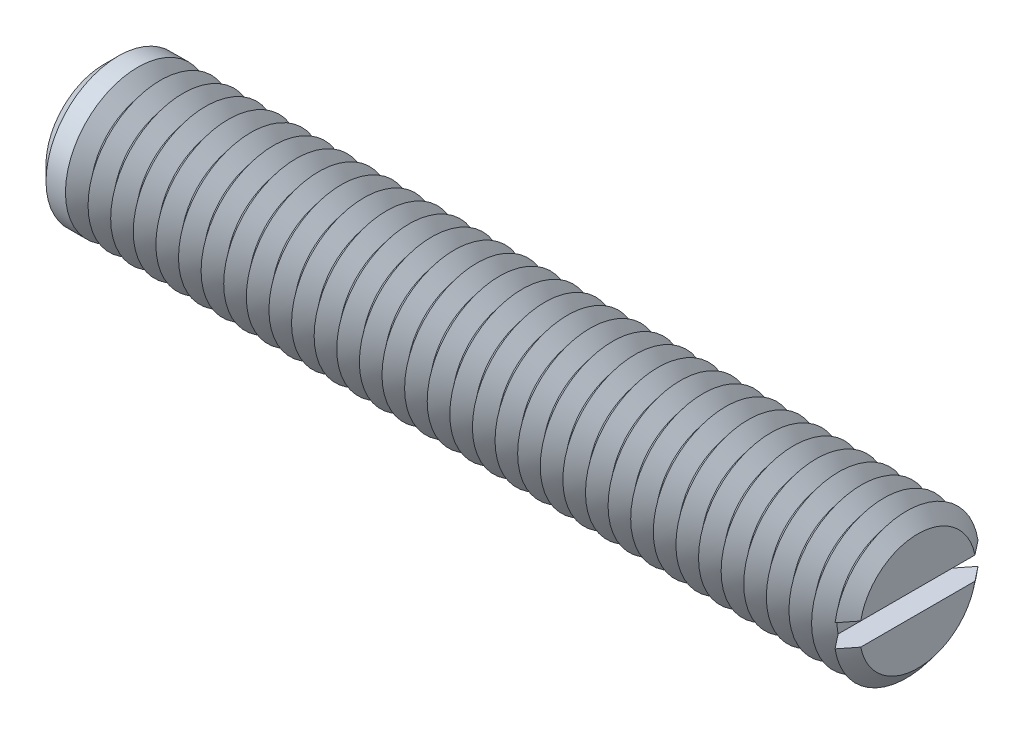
ISO-10303-21;
HEADER;
FILE_DESCRIPTION(('STEP AP214'),'2;1');
FILE_NAME('part.step','',(''),(''),'','','');
FILE_SCHEMA(('AUTOMOTIVE_DESIGN { 1 0 10303 214 1 1 1 1 }'));
ENDSEC;
DATA;
#1=APPLICATION_CONTEXT('core data for automotive mechanical design processes');
#2=APPLICATION_PROTOCOL_DEFINITION('international standard','automotive_design',2000,#1);
#3=PRODUCT_CONTEXT('',#1,'mechanical');
#4=PRODUCT('Part','Part','',(#3));
#5=PRODUCT_RELATED_PRODUCT_CATEGORY('part','',(#4));
#6=PRODUCT_DEFINITION_FORMATION('','',#4);
#7=PRODUCT_DEFINITION_CONTEXT('part definition',#1,'design');
#8=PRODUCT_DEFINITION('design','',#6,#7);
#9=PRODUCT_DEFINITION_SHAPE('','',#8);
#10=(LENGTH_UNIT() NAMED_UNIT(*) SI_UNIT(.MILLI.,.METRE.));
#11=(NAMED_UNIT(*) PLANE_ANGLE_UNIT() SI_UNIT($,.RADIAN.));
#12=(NAMED_UNIT(*) SI_UNIT($,.STERADIAN.) SOLID_ANGLE_UNIT());
#13=UNCERTAINTY_MEASURE_WITH_UNIT(LENGTH_MEASURE(1.E-05),#10,'distance_accuracy_value','');
#14=(GEOMETRIC_REPRESENTATION_CONTEXT(3) GLOBAL_UNCERTAINTY_ASSIGNED_CONTEXT((#13)) GLOBAL_UNIT_ASSIGNED_CONTEXT((#10,
#11,#12)) REPRESENTATION_CONTEXT('',''));
#15=CARTESIAN_POINT('',(0.,0.,0.));
#16=DIRECTION('',(0.,0.,1.));
#17=DIRECTION('',(1.,0.,0.));
#18=AXIS2_PLACEMENT_3D('',#15,#16,#17);
#19=CARTESIAN_POINT('',(21.875,0.,0.));
#20=DIRECTION('',(1.,0.,0.));
#21=DIRECTION('',(0.,0.,-1.));
#22=AXIS2_PLACEMENT_3D('',#19,#20,#21);
#23=CONICAL_SURFACE('',#22,4.,0.895664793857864);
#24=CARTESIAN_POINT('',(21.875,0.,0.));
#25=DIRECTION('',(-1.,0.,0.));
#26=DIRECTION('',(0.,0.,1.));
#27=AXIS2_PLACEMENT_3D('',#24,#25,#26);
#28=CIRCLE('',#27,4.);
#29=CARTESIAN_POINT('',(21.875,-0.625,-3.95087015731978));
#30=VERTEX_POINT('',#29);
#31=CARTESIAN_POINT('',(21.875,-0.625,3.95087015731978));
#32=VERTEX_POINT('',#31);
#33=EDGE_CURVE('E117',#30,#32,#28,.T.);
#34=ORIENTED_EDGE('',*,*,#33,.T.);
#35=CARTESIAN_POINT('',(25.6614902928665,-0.625,-8.70692181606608));
#36=CARTESIAN_POINT('',(25.4148555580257,-0.625,-8.39807520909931));
#37=CARTESIAN_POINT('',(25.1682552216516,-0.625,-8.08920109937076));
#38=CARTESIAN_POINT('',(24.6751408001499,-0.625,-7.47132164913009));
#39=CARTESIAN_POINT('',(24.4286267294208,-0.625,-7.16231629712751));
#40=CARTESIAN_POINT('',(23.9351922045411,-0.625,-6.54345822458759));
#41=CARTESIAN_POINT('',(23.6882721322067,-0.625,-6.23360519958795));
#42=CARTESIAN_POINT('',(23.1947157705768,-0.625,-5.61373487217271));
#43=CARTESIAN_POINT('',(22.9480794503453,-0.625,-5.30371759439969));
#44=CARTESIAN_POINT('',(22.5704817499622,-0.625,-4.82841623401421));
#45=CARTESIAN_POINT('',(22.4393680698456,-0.625,-4.66325315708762));
#46=CARTESIAN_POINT('',(22.1773052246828,-0.625,-4.33279290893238));
#47=CARTESIAN_POINT('',(22.0463560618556,-0.625,-4.16749573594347));
#48=CARTESIAN_POINT('',(21.7846416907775,-0.625,-3.83665276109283));
#49=CARTESIAN_POINT('',(21.6538765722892,-0.625,-3.67110688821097));
#50=CARTESIAN_POINT('',(21.392697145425,-0.625,-3.33975147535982));
#51=CARTESIAN_POINT('',(21.2622828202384,-0.625,-3.17394194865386));
#52=CARTESIAN_POINT('',(21.0022082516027,-0.625,-2.84217045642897));
#53=CARTESIAN_POINT('',(20.8725471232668,-0.625,-2.6762091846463));
#54=CARTESIAN_POINT('',(20.6140928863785,-0.625,-2.34356113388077));
#55=CARTESIAN_POINT('',(20.485299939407,-0.625,-2.17687422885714));
#56=CARTESIAN_POINT('',(20.2934479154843,-0.625,-1.92591523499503));
#57=CARTESIAN_POINT('',(20.2297426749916,-0.625,-1.84213757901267));
#58=CARTESIAN_POINT('',(20.1029724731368,-0.625,-1.67409978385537));
#59=CARTESIAN_POINT('',(20.0399075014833,-0.625,-1.58983965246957));
#60=CARTESIAN_POINT('',(19.9147785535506,-0.625,-1.42061659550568));
#61=CARTESIAN_POINT('',(19.8527142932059,-0.625,-1.33565388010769));
#62=CARTESIAN_POINT('',(19.7301881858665,-0.625,-1.16458302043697));
#63=CARTESIAN_POINT('',(19.6697261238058,-0.625,-1.0784750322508));
#64=CARTESIAN_POINT('',(19.5976838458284,-0.625,-0.97209256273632));
#65=CARTESIAN_POINT('',(19.5847024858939,-0.625,-0.952767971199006));
#66=CARTESIAN_POINT('',(19.558912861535,-0.625,-0.914003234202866));
#67=CARTESIAN_POINT('',(19.5461046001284,-0.625,-0.894563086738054));
#68=CARTESIAN_POINT('',(19.5079767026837,-0.625,-0.836043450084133));
#69=CARTESIAN_POINT('',(19.4829560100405,-0.625,-0.79676778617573));
#70=CARTESIAN_POINT('',(19.4339776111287,-0.625,-0.717444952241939));
#71=CARTESIAN_POINT('',(19.4100221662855,-0.625,-0.677396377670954));
#72=CARTESIAN_POINT('',(19.3637207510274,-0.625,-0.596377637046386));
#73=CARTESIAN_POINT('',(19.3413744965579,-0.625,-0.555407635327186));
#74=CARTESIAN_POINT('',(19.3059952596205,-0.625,-0.485816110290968));
#75=CARTESIAN_POINT('',(19.2923049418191,-0.625,-0.457533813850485));
#76=CARTESIAN_POINT('',(19.266378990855,-0.625,-0.400313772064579));
#77=CARTESIAN_POINT('',(19.2541438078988,-0.625,-0.371375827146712));
#78=CARTESIAN_POINT('',(19.2204304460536,-0.625,-0.283641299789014));
#79=CARTESIAN_POINT('',(19.2017774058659,-0.625,-0.223617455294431));
#80=CARTESIAN_POINT('',(19.1847644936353,-0.625,-0.139102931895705));
#81=CARTESIAN_POINT('',(19.18099555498,-0.625,-0.115688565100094));
#82=CARTESIAN_POINT('',(19.1755004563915,-0.625,-0.0686260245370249));
#83=CARTESIAN_POINT('',(19.1737732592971,-0.625,-0.0449779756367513));
#84=CARTESIAN_POINT('',(19.1724835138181,-0.625,0.0023433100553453));
#85=CARTESIAN_POINT('',(19.172917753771,-0.625,0.0260164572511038));
#86=CARTESIAN_POINT('',(19.1759063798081,-0.625,0.0732268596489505));
#87=CARTESIAN_POINT('',(19.1784611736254,-0.625,0.0967640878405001));
#88=CARTESIAN_POINT('',(19.191400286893,-0.625,0.182271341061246));
#89=CARTESIAN_POINT('',(19.207744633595,-0.625,0.243366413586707));
#90=CARTESIAN_POINT('',(19.2388887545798,-0.625,0.332669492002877));
#91=CARTESIAN_POINT('',(19.2504419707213,-0.625,0.362174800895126));
#92=CARTESIAN_POINT('',(19.2752210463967,-0.625,0.42048117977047));
#93=CARTESIAN_POINT('',(19.2884464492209,-0.625,0.449282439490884));
#94=CARTESIAN_POINT('',(19.3174677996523,-0.625,0.508972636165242));
#95=CARTESIAN_POINT('',(19.3333885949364,-0.625,0.539799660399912));
#96=CARTESIAN_POINT('',(19.3663425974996,-0.625,0.600856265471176));
#97=CARTESIAN_POINT('',(19.3833759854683,-0.625,0.631085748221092));
#98=CARTESIAN_POINT('',(19.4357348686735,-0.625,0.72110013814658));
#99=CARTESIAN_POINT('',(19.4722948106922,-0.625,0.780163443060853));
#100=CARTESIAN_POINT('',(19.5474296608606,-0.625,0.897183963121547));
#101=CARTESIAN_POINT('',(19.5860094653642,-0.625,0.955137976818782));
#102=CARTESIAN_POINT('',(19.6644096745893,-0.625,1.07020655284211));
#103=CARTESIAN_POINT('',(19.7042302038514,-0.625,1.12732103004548));
#104=CARTESIAN_POINT('',(19.7847841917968,-0.625,1.24108525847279));
#105=CARTESIAN_POINT('',(19.8255194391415,-0.625,1.29773373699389));
#106=CARTESIAN_POINT('',(19.9075780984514,-0.625,1.41061176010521));
#107=CARTESIAN_POINT('',(19.9489015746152,-0.625,1.46684125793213));
#108=CARTESIAN_POINT('',(20.0733456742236,-0.625,1.63486189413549));
#109=CARTESIAN_POINT('',(20.1570882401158,-0.625,1.74619171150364));
#110=CARTESIAN_POINT('',(20.3245788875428,-0.625,1.96690364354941));
#111=CARTESIAN_POINT('',(20.4083166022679,-0.625,2.07629366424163));
#112=CARTESIAN_POINT('',(20.5763821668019,-0.625,2.29462016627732));
#113=CARTESIAN_POINT('',(20.6607100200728,-0.625,2.40355664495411));
#114=CARTESIAN_POINT('',(20.9142762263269,-0.625,2.72992534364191));
#115=CARTESIAN_POINT('',(21.0840912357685,-0.625,2.94690900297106));
#116=CARTESIAN_POINT('',(21.4246141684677,-0.625,3.38042406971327));
#117=CARTESIAN_POINT('',(21.595322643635,-0.625,3.5969550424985));
#118=CARTESIAN_POINT('',(21.9371950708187,-0.625,4.02965109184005));
#119=CARTESIAN_POINT('',(22.1083590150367,-0.625,4.24581617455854));
#120=CARTESIAN_POINT('',(22.4504500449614,-0.625,4.67725748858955));
#121=CARTESIAN_POINT('',(22.6213762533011,-0.625,4.89253441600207));
#122=CARTESIAN_POINT('',(22.9634226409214,-0.625,5.32293566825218));
#123=CARTESIAN_POINT('',(23.134542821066,-0.625,5.53805999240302));
#124=CARTESIAN_POINT('',(23.6480384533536,-0.625,6.18319284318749));
#125=CARTESIAN_POINT('',(23.9906134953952,-0.625,6.61304248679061));
#126=CARTESIAN_POINT('',(24.4438892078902,-0.625,7.18140561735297));
#127=CARTESIAN_POINT('',(24.5544613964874,-0.625,7.32002163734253));
#128=CARTESIAN_POINT('',(24.7756363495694,-0.625,7.59723760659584));
#129=CARTESIAN_POINT('',(24.886239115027,-0.625,7.73583755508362));
#130=CARTESIAN_POINT('',(25.1076076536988,-0.625,8.01319622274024));
#131=CARTESIAN_POINT('',(25.2183734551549,-0.625,8.15195491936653));
#132=CARTESIAN_POINT('',(25.439920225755,-0.625,8.42945184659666));
#133=CARTESIAN_POINT('',(25.5507011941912,-0.625,8.56819007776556));
#134=CARTESIAN_POINT('',(25.6614902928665,-0.625,8.70692181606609));
#135=B_SPLINE_CURVE_WITH_KNOTS('',3,(#35,#36,#37,#38,#39,#40,#41,#42,#43,#44,#45,#46,#47,#48,
#49,#50,#51,#52,#53,#54,#55,#56,#57,#58,#59,#60,#61,#62,#63,#64,#65,#66,#67,#68,#69,#70,#71,#72,
#73,#74,#75,#76,#77,#78,#79,#80,#81,#82,#83,#84,#85,#86,#87,#88,#89,#90,#91,#92,#93,#94,#95,#96,
#97,#98,#99,#100,#101,#102,#103,#104,#105,#106,#107,#108,#109,#110,#111,#112,#113,#114,#115,
#116,#117,#118,#119,#120,#121,#122,#123,#124,#125,#126,#127,#128,#129,#130,#131,#132,#133,#134),
.UNSPECIFIED.,.F.,.F.,(4,2,2,2,2,2,2,2,2,2,2,2,2,2,2,2,2,2,2,2,2,2,2,2,2,2,2,2,2,2,2,2,2,2,2,2,
2,2,2,2,2,2,2,2,2,2,2,2,2,4),(0.,1.18572103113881,2.37158837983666,3.5602033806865,
4.7486734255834,5.38130812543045,6.01395126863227,6.646836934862,7.27969171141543,
7.91151062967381,8.54344406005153,8.85918511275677,9.17492108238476,9.49056578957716,
9.8061679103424,9.8760068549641,9.94584701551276,10.0855382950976,10.2255132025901,
10.3654633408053,10.4596856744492,10.5539370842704,10.741396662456,10.8124690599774,
10.8835053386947,10.9544360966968,11.0253804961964,11.2137597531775,11.3088096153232,
11.403833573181,11.5078935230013,11.6119704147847,11.8202840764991,12.0291284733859,
12.2379939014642,12.4473111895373,12.6566515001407,13.0745694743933,13.4878513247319,
13.9011356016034,14.7277337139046,15.5549232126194,16.3820986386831,17.2067434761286,
18.0313920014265,19.6803778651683,20.2123228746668,20.7442873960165,21.2769292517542,
21.8095515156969),.UNSPECIFIED.);
#136=CARTESIAN_POINT('',(21.25,-0.625,3.1581247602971));
#137=VERTEX_POINT('',#136);
#138=EDGE_CURVE('E109',#137,#32,#135,.T.);
#139=ORIENTED_EDGE('',*,*,#138,.F.);
#140=CARTESIAN_POINT('',(21.25,0.,0.));
#141=DIRECTION('',(-1.,0.,0.));
#142=DIRECTION('',(0.,0.,1.));
#143=AXIS2_PLACEMENT_3D('',#140,#141,#142);
#144=CIRCLE('',#143,3.2193752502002);
#145=CARTESIAN_POINT('',(21.25,-0.625,-3.1581247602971));
#146=VERTEX_POINT('',#145);
#147=EDGE_CURVE('E495',#146,#137,#144,.T.);
#148=ORIENTED_EDGE('',*,*,#147,.F.);
#149=EDGE_CURVE('E58',#30,#146,#135,.T.);
#150=ORIENTED_EDGE('',*,*,#149,.F.);
#151=EDGE_LOOP('',(#34,#139,#148,#150));
#152=FACE_BOUND('',#151,.T.);
#153=ADVANCED_FACE('F37',(#152),#23,.T.);
#154=CARTESIAN_POINT('',(21.875,0.625,3.95087015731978));
#155=VERTEX_POINT('',#154);
#156=CARTESIAN_POINT('',(21.875,0.625,-3.95087015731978));
#157=VERTEX_POINT('',#156);
#158=EDGE_CURVE('E100',#155,#157,#28,.T.);
#159=ORIENTED_EDGE('',*,*,#158,.T.);
#160=CARTESIAN_POINT('',(25.6614902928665,0.625,8.70692181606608));
#161=CARTESIAN_POINT('',(25.4148555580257,0.625,8.39807520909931));
#162=CARTESIAN_POINT('',(25.1682552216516,0.625,8.08920109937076));
#163=CARTESIAN_POINT('',(24.6751408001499,0.625,7.47132164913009));
#164=CARTESIAN_POINT('',(24.4286267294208,0.625,7.16231629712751));
#165=CARTESIAN_POINT('',(23.9351922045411,0.625,6.54345822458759));
#166=CARTESIAN_POINT('',(23.6882721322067,0.625,6.23360519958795));
#167=CARTESIAN_POINT('',(23.1947157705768,0.625,5.61373487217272));
#168=CARTESIAN_POINT('',(22.9480794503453,0.625,5.3037175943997));
#169=CARTESIAN_POINT('',(22.5704817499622,0.625,4.82841623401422));
#170=CARTESIAN_POINT('',(22.4393680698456,0.625,4.66325315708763));
#171=CARTESIAN_POINT('',(22.1773052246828,0.625,4.33279290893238));
#172=CARTESIAN_POINT('',(22.0463560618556,0.625,4.16749573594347));
#173=CARTESIAN_POINT('',(21.7846416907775,0.625,3.83665276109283));
#174=CARTESIAN_POINT('',(21.6538765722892,0.625,3.67110688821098));
#175=CARTESIAN_POINT('',(21.392697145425,0.625,3.33975147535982));
#176=CARTESIAN_POINT('',(21.2622828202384,0.625,3.17394194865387));
#177=CARTESIAN_POINT('',(21.0022082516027,0.625,2.84217045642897));
#178=CARTESIAN_POINT('',(20.8725471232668,0.625,2.6762091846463));
#179=CARTESIAN_POINT('',(20.6140928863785,0.625,2.34356113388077));
#180=CARTESIAN_POINT('',(20.485299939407,0.625,2.17687422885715));
#181=CARTESIAN_POINT('',(20.2934479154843,0.625,1.92591523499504));
#182=CARTESIAN_POINT('',(20.2297426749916,0.625,1.84213757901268));
#183=CARTESIAN_POINT('',(20.1029724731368,0.625,1.67409978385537));
#184=CARTESIAN_POINT('',(20.0399075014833,0.625,1.58983965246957));
#185=CARTESIAN_POINT('',(19.9147785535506,0.625,1.42061659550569));
#186=CARTESIAN_POINT('',(19.8527142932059,0.625,1.3356538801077));
#187=CARTESIAN_POINT('',(19.7301881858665,0.625,1.16458302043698));
#188=CARTESIAN_POINT('',(19.6697261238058,0.625,1.0784750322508));
#189=CARTESIAN_POINT('',(19.5976838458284,0.625,0.97209256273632));
#190=CARTESIAN_POINT('',(19.5847024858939,0.625,0.952767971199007));
#191=CARTESIAN_POINT('',(19.558912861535,0.625,0.914003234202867));
#192=CARTESIAN_POINT('',(19.5461046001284,0.625,0.894563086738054));
#193=CARTESIAN_POINT('',(19.5079767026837,0.625,0.836043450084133));
#194=CARTESIAN_POINT('',(19.4829560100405,0.625,0.79676778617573));
#195=CARTESIAN_POINT('',(19.4339776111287,0.625,0.717444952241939));
#196=CARTESIAN_POINT('',(19.4100221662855,0.625,0.677396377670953));
#197=CARTESIAN_POINT('',(19.3637207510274,0.625,0.596377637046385));
#198=CARTESIAN_POINT('',(19.3413744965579,0.625,0.555407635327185));
#199=CARTESIAN_POINT('',(19.3059952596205,0.625,0.485816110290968));
#200=CARTESIAN_POINT('',(19.2923049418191,0.625,0.457533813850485));
#201=CARTESIAN_POINT('',(19.266378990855,0.625,0.400313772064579));
#202=CARTESIAN_POINT('',(19.2541438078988,0.625,0.371375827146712));
#203=CARTESIAN_POINT('',(19.2204304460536,0.625,0.283641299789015));
#204=CARTESIAN_POINT('',(19.2017774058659,0.625,0.223617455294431));
#205=CARTESIAN_POINT('',(19.1847644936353,0.625,0.139102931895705));
#206=CARTESIAN_POINT('',(19.18099555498,0.625,0.115688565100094));
#207=CARTESIAN_POINT('',(19.1755004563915,0.625,0.0686260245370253));
#208=CARTESIAN_POINT('',(19.1737732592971,0.625,0.0449779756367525));
#209=CARTESIAN_POINT('',(19.1724835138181,0.625,-0.00234331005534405));
#210=CARTESIAN_POINT('',(19.172917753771,0.625,-0.0260164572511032));
#211=CARTESIAN_POINT('',(19.1759063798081,0.625,-0.0732268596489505));
#212=CARTESIAN_POINT('',(19.1784611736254,0.625,-0.0967640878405));
#213=CARTESIAN_POINT('',(19.191400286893,0.625,-0.182271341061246));
#214=CARTESIAN_POINT('',(19.207744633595,0.625,-0.243366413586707));
#215=CARTESIAN_POINT('',(19.2388887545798,0.625,-0.332669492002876));
#216=CARTESIAN_POINT('',(19.2504419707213,0.625,-0.362174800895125));
#217=CARTESIAN_POINT('',(19.2752210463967,0.625,-0.420481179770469));
#218=CARTESIAN_POINT('',(19.2884464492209,0.625,-0.449282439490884));
#219=CARTESIAN_POINT('',(19.3174677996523,0.625,-0.508972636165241));
#220=CARTESIAN_POINT('',(19.3333885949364,0.625,-0.539799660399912));
#221=CARTESIAN_POINT('',(19.3663425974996,0.625,-0.600856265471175));
#222=CARTESIAN_POINT('',(19.3833759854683,0.625,-0.631085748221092));
#223=CARTESIAN_POINT('',(19.4357348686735,0.625,-0.72110013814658));
#224=CARTESIAN_POINT('',(19.4722948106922,0.625,-0.780163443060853));
#225=CARTESIAN_POINT('',(19.5474296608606,0.625,-0.897183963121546));
#226=CARTESIAN_POINT('',(19.5860094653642,0.625,-0.955137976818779));
#227=CARTESIAN_POINT('',(19.6644096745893,0.625,-1.0702065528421));
#228=CARTESIAN_POINT('',(19.7042302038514,0.625,-1.12732103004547));
#229=CARTESIAN_POINT('',(19.7847841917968,0.625,-1.24108525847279));
#230=CARTESIAN_POINT('',(19.8255194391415,0.625,-1.29773373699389));
#231=CARTESIAN_POINT('',(19.9075780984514,0.625,-1.41061176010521));
#232=CARTESIAN_POINT('',(19.9489015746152,0.625,-1.46684125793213));
#233=CARTESIAN_POINT('',(20.0733456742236,0.625,-1.63486189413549));
#234=CARTESIAN_POINT('',(20.1570882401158,0.625,-1.74619171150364));
#235=CARTESIAN_POINT('',(20.3245788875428,0.625,-1.96690364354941));
#236=CARTESIAN_POINT('',(20.4083166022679,0.625,-2.07629366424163));
#237=CARTESIAN_POINT('',(20.5763821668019,0.625,-2.29462016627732));
#238=CARTESIAN_POINT('',(20.6607100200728,0.625,-2.40355664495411));
#239=CARTESIAN_POINT('',(20.9142762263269,0.625,-2.72992534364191));
#240=CARTESIAN_POINT('',(21.0840912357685,0.625,-2.94690900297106));
#241=CARTESIAN_POINT('',(21.4246141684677,0.625,-3.38042406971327));
#242=CARTESIAN_POINT('',(21.595322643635,0.625,-3.5969550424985));
#243=CARTESIAN_POINT('',(21.9371950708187,0.625,-4.02965109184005));
#244=CARTESIAN_POINT('',(22.1083590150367,0.625,-4.24581617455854));
#245=CARTESIAN_POINT('',(22.4504500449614,0.625,-4.67725748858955));
#246=CARTESIAN_POINT('',(22.6213762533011,0.625,-4.89253441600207));
#247=CARTESIAN_POINT('',(22.9634226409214,0.625,-5.32293566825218));
#248=CARTESIAN_POINT('',(23.134542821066,0.625,-5.53805999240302));
#249=CARTESIAN_POINT('',(23.6480384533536,0.625,-6.18319284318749));
#250=CARTESIAN_POINT('',(23.9906134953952,0.625,-6.6130424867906));
#251=CARTESIAN_POINT('',(24.4438892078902,0.625,-7.18140561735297));
#252=CARTESIAN_POINT('',(24.5544613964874,0.625,-7.32002163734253));
#253=CARTESIAN_POINT('',(24.7756363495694,0.625,-7.59723760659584));
#254=CARTESIAN_POINT('',(24.886239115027,0.625,-7.73583755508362));
#255=CARTESIAN_POINT('',(25.1076076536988,0.625,-8.01319622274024));
#256=CARTESIAN_POINT('',(25.2183734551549,0.625,-8.15195491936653));
#257=CARTESIAN_POINT('',(25.439920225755,0.625,-8.42945184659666));
#258=CARTESIAN_POINT('',(25.5507011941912,0.625,-8.56819007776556));
#259=CARTESIAN_POINT('',(25.6614902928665,0.625,-8.70692181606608));
#260=B_SPLINE_CURVE_WITH_KNOTS('',3,(#160,#161,#162,#163,#164,#165,#166,#167,#168,#169,#170,
#171,#172,#173,#174,#175,#176,#177,#178,#179,#180,#181,#182,#183,#184,#185,#186,#187,#188,#189,
#190,#191,#192,#193,#194,#195,#196,#197,#198,#199,#200,#201,#202,#203,#204,#205,#206,#207,#208,
#209,#210,#211,#212,#213,#214,#215,#216,#217,#218,#219,#220,#221,#222,#223,#224,#225,#226,#227,
#228,#229,#230,#231,#232,#233,#234,#235,#236,#237,#238,#239,#240,#241,#242,#243,#244,#245,#246,
#247,#248,#249,#250,#251,#252,#253,#254,#255,#256,#257,#258,#259),.UNSPECIFIED.,.F.,.F.,(4,2,2,
2,2,2,2,2,2,2,2,2,2,2,2,2,2,2,2,2,2,2,2,2,2,2,2,2,2,2,2,2,2,2,2,2,2,2,2,2,2,2,2,2,2,2,2,2,2,4),
(0.,1.18572103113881,2.37158837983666,3.56020338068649,4.74867342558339,5.38130812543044,
6.01395126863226,6.64683693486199,7.27969171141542,7.9115106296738,8.54344406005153,
8.85918511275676,9.17492108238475,9.49056578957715,9.8061679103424,9.8760068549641,
9.94584701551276,10.0855382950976,10.2255132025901,10.3654633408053,10.4596856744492,
10.5539370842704,10.741396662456,10.8124690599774,10.8835053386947,10.9544360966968,
11.0253804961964,11.2137597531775,11.3088096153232,11.403833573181,11.5078935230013,
11.6119704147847,11.8202840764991,12.0291284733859,12.2379939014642,12.4473111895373,
12.6566515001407,13.0745694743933,13.4878513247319,13.9011356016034,14.7277337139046,
15.5549232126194,16.3820986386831,17.2067434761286,18.0313920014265,19.6803778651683,
20.2123228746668,20.7442873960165,21.2769292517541,21.8095515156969),.UNSPECIFIED.);
#261=CARTESIAN_POINT('',(21.25,0.625,-3.1581247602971));
#262=VERTEX_POINT('',#261);
#263=EDGE_CURVE('E110',#262,#157,#260,.T.);
#264=ORIENTED_EDGE('',*,*,#263,.F.);
#265=CARTESIAN_POINT('',(21.25,0.625,3.1581247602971));
#266=VERTEX_POINT('',#265);
#267=EDGE_CURVE('E103',#266,#262,#144,.T.);
#268=ORIENTED_EDGE('',*,*,#267,.F.);
#269=EDGE_CURVE('E97',#155,#266,#260,.T.);
#270=ORIENTED_EDGE('',*,*,#269,.F.);
#271=EDGE_LOOP('',(#159,#264,#268,#270));
#272=FACE_BOUND('',#271,.T.);
#273=ADVANCED_FACE('F99',(#272),#23,.T.);
#274=CARTESIAN_POINT('',(21.25,0.,0.));
#275=DIRECTION('',(-1.,0.,0.));
#276=DIRECTION('',(0.,0.,1.));
#277=AXIS2_PLACEMENT_3D('',#274,#275,#276);
#278=CONICAL_SURFACE('',#277,3.2193752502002,0.895664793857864);
#279=CARTESIAN_POINT('',(20.625,0.,0.));
#280=DIRECTION('',(-1.,0.,0.));
#281=DIRECTION('',(0.,0.,1.));
#282=AXIS2_PLACEMENT_3D('',#279,#280,#281);
#283=CIRCLE('',#282,4.);
#284=CARTESIAN_POINT('',(20.625,0.,4.));
#285=VERTEX_POINT('',#284);
#286=EDGE_CURVE('E481',#285,#285,#283,.T.);
#287=ORIENTED_EDGE('',*,*,#286,.F.);
#288=EDGE_LOOP('',(#287));
#289=FACE_BOUND('',#288,.T.);
#290=ORIENTED_EDGE('',*,*,#267,.T.);
#291=EDGE_CURVE('E490',#262,#146,#144,.T.);
#292=ORIENTED_EDGE('',*,*,#291,.T.);
#293=ORIENTED_EDGE('',*,*,#147,.T.);
#294=EDGE_CURVE('E488',#137,#266,#144,.T.);
#295=ORIENTED_EDGE('',*,*,#294,.T.);
#296=EDGE_LOOP('',(#290,#292,#293,#295));
#297=FACE_BOUND('',#296,.T.);
#298=ADVANCED_FACE('F166',(#289,#297),#278,.T.);
#299=CARTESIAN_POINT('',(22.5,0.,0.));
#300=DIRECTION('',(1.,0.,0.));
#301=DIRECTION('',(0.,0.,-1.));
#302=AXIS2_PLACEMENT_3D('',#299,#300,#301);
#303=PLANE('',#302);
#304=CARTESIAN_POINT('',(22.5,0.,0.));
#305=DIRECTION('',(-1.,0.,0.));
#306=DIRECTION('',(0.,0.,1.));
#307=AXIS2_PLACEMENT_3D('',#304,#305,#306);
#308=CIRCLE('',#307,3.2193752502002);
#309=CARTESIAN_POINT('',(22.5,0.625,3.1581247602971));
#310=VERTEX_POINT('',#309);
#311=CARTESIAN_POINT('',(22.5,0.625,-3.1581247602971));
#312=VERTEX_POINT('',#311);
#313=EDGE_CURVE('E158',#310,#312,#308,.T.);
#314=ORIENTED_EDGE('',*,*,#313,.F.);
#315=DIRECTION('',(0.,0.,1.));
#316=VECTOR('',#315,1.);
#317=CARTESIAN_POINT('',(22.5,0.625,0.));
#318=LINE('',#317,#316);
#319=EDGE_CURVE('E122',#312,#310,#318,.T.);
#320=ORIENTED_EDGE('',*,*,#319,.F.);
#321=EDGE_LOOP('',(#314,#320));
#322=FACE_BOUND('',#321,.T.);
#323=ADVANCED_FACE('F170',(#322),#303,.T.);
#324=CARTESIAN_POINT('',(22.5,-0.625,-3.1581247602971));
#325=VERTEX_POINT('',#324);
#326=CARTESIAN_POINT('',(22.5,-0.625,3.1581247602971));
#327=VERTEX_POINT('',#326);
#328=EDGE_CURVE('E66',#325,#327,#308,.T.);
#329=ORIENTED_EDGE('',*,*,#328,.F.);
#330=DIRECTION('',(0.,0.,-1.));
#331=VECTOR('',#330,1.);
#332=CARTESIAN_POINT('',(22.5,-0.625,0.));
#333=LINE('',#332,#331);
#334=EDGE_CURVE('E135',#327,#325,#333,.T.);
#335=ORIENTED_EDGE('',*,*,#334,.F.);
#336=EDGE_LOOP('',(#329,#335));
#337=FACE_BOUND('',#336,.T.);
#338=ADVANCED_FACE('F199',(#337),#303,.T.);
#339=CARTESIAN_POINT('',(22.5,0.,0.));
#340=DIRECTION('',(-1.,0.,0.));
#341=DIRECTION('',(0.,0.,1.));
#342=AXIS2_PLACEMENT_3D('',#339,#340,#341);
#343=CONICAL_SURFACE('',#342,3.2193752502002,0.895664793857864);
#344=ORIENTED_EDGE('',*,*,#158,.F.);
#345=CARTESIAN_POINT('',(18.0885097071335,0.625,-8.70692181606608));
#346=CARTESIAN_POINT('',(18.3351444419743,0.625,-8.39807520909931));
#347=CARTESIAN_POINT('',(18.5817447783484,0.625,-8.08920109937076));
#348=CARTESIAN_POINT('',(19.07485919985,0.625,-7.47132164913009));
#349=CARTESIAN_POINT('',(19.3213732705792,0.625,-7.16231629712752));
#350=CARTESIAN_POINT('',(19.8148077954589,0.625,-6.54345822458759));
#351=CARTESIAN_POINT('',(20.0617278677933,0.625,-6.23360519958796));
#352=CARTESIAN_POINT('',(20.5552842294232,0.625,-5.61373487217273));
#353=CARTESIAN_POINT('',(20.8019205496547,0.625,-5.30371759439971));
#354=CARTESIAN_POINT('',(21.1795182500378,0.625,-4.82841623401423));
#355=CARTESIAN_POINT('',(21.3106319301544,0.625,-4.66325315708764));
#356=CARTESIAN_POINT('',(21.5726947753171,0.625,-4.33279290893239));
#357=CARTESIAN_POINT('',(21.7036439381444,0.625,-4.16749573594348));
#358=CARTESIAN_POINT('',(21.9653583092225,0.625,-3.83665276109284));
#359=CARTESIAN_POINT('',(22.0961234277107,0.625,-3.67110688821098));
#360=CARTESIAN_POINT('',(22.357302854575,0.625,-3.33975147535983));
#361=CARTESIAN_POINT('',(22.4877171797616,0.625,-3.17394194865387));
#362=CARTESIAN_POINT('',(22.7477917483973,0.625,-2.84217045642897));
#363=CARTESIAN_POINT('',(22.8774528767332,0.625,-2.6762091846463));
#364=CARTESIAN_POINT('',(23.1359071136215,0.625,-2.34356113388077));
#365=CARTESIAN_POINT('',(23.264700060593,0.625,-2.17687422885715));
#366=CARTESIAN_POINT('',(23.4565520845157,0.625,-1.92591523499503));
#367=CARTESIAN_POINT('',(23.5202573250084,0.625,-1.84213757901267));
#368=CARTESIAN_POINT('',(23.6470275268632,0.625,-1.67409978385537));
#369=CARTESIAN_POINT('',(23.7100924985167,0.625,-1.58983965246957));
#370=CARTESIAN_POINT('',(23.8352214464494,0.625,-1.42061659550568));
#371=CARTESIAN_POINT('',(23.8972857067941,0.625,-1.3356538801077));
#372=CARTESIAN_POINT('',(24.0198118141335,0.625,-1.16458302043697));
#373=CARTESIAN_POINT('',(24.0802738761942,0.625,-1.0784750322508));
#374=CARTESIAN_POINT('',(24.1523161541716,0.625,-0.97209256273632));
#375=CARTESIAN_POINT('',(24.1652975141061,0.625,-0.952767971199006));
#376=CARTESIAN_POINT('',(24.1910871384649,0.625,-0.914003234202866));
#377=CARTESIAN_POINT('',(24.2038953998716,0.625,-0.894563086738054));
#378=CARTESIAN_POINT('',(24.2420232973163,0.625,-0.836043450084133));
#379=CARTESIAN_POINT('',(24.2670439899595,0.625,-0.796767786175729));
#380=CARTESIAN_POINT('',(24.3160223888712,0.625,-0.717444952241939));
#381=CARTESIAN_POINT('',(24.3399778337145,0.625,-0.677396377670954));
#382=CARTESIAN_POINT('',(24.3862792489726,0.625,-0.596377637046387));
#383=CARTESIAN_POINT('',(24.4086255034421,0.625,-0.555407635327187));
#384=CARTESIAN_POINT('',(24.4440047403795,0.625,-0.485816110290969));
#385=CARTESIAN_POINT('',(24.4576950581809,0.625,-0.457533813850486));
#386=CARTESIAN_POINT('',(24.483621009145,0.625,-0.40031377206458));
#387=CARTESIAN_POINT('',(24.4958561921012,0.625,-0.371375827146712));
#388=CARTESIAN_POINT('',(24.5295695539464,0.625,-0.283641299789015));
#389=CARTESIAN_POINT('',(24.5482225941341,0.625,-0.223617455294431));
#390=CARTESIAN_POINT('',(24.5652355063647,0.625,-0.139102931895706));
#391=CARTESIAN_POINT('',(24.56900444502,0.625,-0.115688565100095));
#392=CARTESIAN_POINT('',(24.5744995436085,0.625,-0.0686260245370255));
#393=CARTESIAN_POINT('',(24.5762267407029,0.625,-0.044977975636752));
#394=CARTESIAN_POINT('',(24.5775164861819,0.625,0.00234331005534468));
#395=CARTESIAN_POINT('',(24.577082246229,0.625,0.0260164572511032));
#396=CARTESIAN_POINT('',(24.5740936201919,0.625,0.0732268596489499));
#397=CARTESIAN_POINT('',(24.5715388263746,0.625,0.0967640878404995));
#398=CARTESIAN_POINT('',(24.558599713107,0.625,0.182271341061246));
#399=CARTESIAN_POINT('',(24.542255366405,0.625,0.243366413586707));
#400=CARTESIAN_POINT('',(24.5111112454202,0.625,0.332669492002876));
#401=CARTESIAN_POINT('',(24.4995580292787,0.625,0.362174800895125));
#402=CARTESIAN_POINT('',(24.4747789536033,0.625,0.420481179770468));
#403=CARTESIAN_POINT('',(24.4615535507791,0.625,0.449282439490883));
#404=CARTESIAN_POINT('',(24.4325322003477,0.625,0.508972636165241));
#405=CARTESIAN_POINT('',(24.4166114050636,0.625,0.539799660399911));
#406=CARTESIAN_POINT('',(24.3836574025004,0.625,0.600856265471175));
#407=CARTESIAN_POINT('',(24.3666240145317,0.625,0.631085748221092));
#408=CARTESIAN_POINT('',(24.3142651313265,0.625,0.721100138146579));
#409=CARTESIAN_POINT('',(24.2777051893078,0.625,0.780163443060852));
#410=CARTESIAN_POINT('',(24.2025703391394,0.625,0.897183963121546));
#411=CARTESIAN_POINT('',(24.1639905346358,0.625,0.95513797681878));
#412=CARTESIAN_POINT('',(24.0855903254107,0.625,1.0702065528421));
#413=CARTESIAN_POINT('',(24.0457697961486,0.625,1.12732103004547));
#414=CARTESIAN_POINT('',(23.9652158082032,0.625,1.24108525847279));
#415=CARTESIAN_POINT('',(23.9244805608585,0.625,1.29773373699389));
#416=CARTESIAN_POINT('',(23.8424219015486,0.625,1.4106117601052));
#417=CARTESIAN_POINT('',(23.8010984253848,0.625,1.46684125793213));
#418=CARTESIAN_POINT('',(23.6766543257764,0.625,1.63486189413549));
#419=CARTESIAN_POINT('',(23.5929117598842,0.625,1.74619171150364));
#420=CARTESIAN_POINT('',(23.4254211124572,0.625,1.96690364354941));
#421=CARTESIAN_POINT('',(23.3416833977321,0.625,2.07629366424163));
#422=CARTESIAN_POINT('',(23.1736178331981,0.625,2.29462016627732));
#423=CARTESIAN_POINT('',(23.0892899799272,0.625,2.40355664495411));
#424=CARTESIAN_POINT('',(22.8357237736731,0.625,2.72992534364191));
#425=CARTESIAN_POINT('',(22.6659087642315,0.625,2.94690900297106));
#426=CARTESIAN_POINT('',(22.3253858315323,0.625,3.38042406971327));
#427=CARTESIAN_POINT('',(22.154677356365,0.625,3.5969550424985));
#428=CARTESIAN_POINT('',(21.8128049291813,0.625,4.02965109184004));
#429=CARTESIAN_POINT('',(21.6416409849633,0.625,4.24581617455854));
#430=CARTESIAN_POINT('',(21.2995499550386,0.625,4.67725748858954));
#431=CARTESIAN_POINT('',(21.1286237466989,0.625,4.89253441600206));
#432=CARTESIAN_POINT('',(20.7865773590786,0.625,5.32293566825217));
#433=CARTESIAN_POINT('',(20.615457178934,0.625,5.53805999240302));
#434=CARTESIAN_POINT('',(20.1019615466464,0.625,6.18319284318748));
#435=CARTESIAN_POINT('',(19.7593865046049,0.625,6.6130424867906));
#436=CARTESIAN_POINT('',(19.3061107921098,0.625,7.18140561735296));
#437=CARTESIAN_POINT('',(19.1955386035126,0.625,7.32002163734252));
#438=CARTESIAN_POINT('',(18.9743636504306,0.625,7.59723760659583));
#439=CARTESIAN_POINT('',(18.863760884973,0.625,7.73583755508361));
#440=CARTESIAN_POINT('',(18.6423923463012,0.625,8.01319622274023));
#441=CARTESIAN_POINT('',(18.5316265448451,0.625,8.15195491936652));
#442=CARTESIAN_POINT('',(18.310079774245,0.625,8.42945184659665));
#443=CARTESIAN_POINT('',(18.1992988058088,0.625,8.56819007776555));
#444=CARTESIAN_POINT('',(18.0885097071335,0.625,8.70692181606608));
#445=B_SPLINE_CURVE_WITH_KNOTS('',3,(#345,#346,#347,#348,#349,#350,#351,#352,#353,#354,#355,
#356,#357,#358,#359,#360,#361,#362,#363,#364,#365,#366,#367,#368,#369,#370,#371,#372,#373,#374,
#375,#376,#377,#378,#379,#380,#381,#382,#383,#384,#385,#386,#387,#388,#389,#390,#391,#392,#393,
#394,#395,#396,#397,#398,#399,#400,#401,#402,#403,#404,#405,#406,#407,#408,#409,#410,#411,#412,
#413,#414,#415,#416,#417,#418,#419,#420,#421,#422,#423,#424,#425,#426,#427,#428,#429,#430,#431,
#432,#433,#434,#435,#436,#437,#438,#439,#440,#441,#442,#443,#444),.UNSPECIFIED.,.F.,.F.,(4,2,2,
2,2,2,2,2,2,2,2,2,2,2,2,2,2,2,2,2,2,2,2,2,2,2,2,2,2,2,2,2,2,2,2,2,2,2,2,2,2,2,2,2,2,2,2,2,2,4),
(0.,1.1857210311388,2.37158837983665,3.56020338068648,4.74867342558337,5.38130812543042,
6.01395126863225,6.64683693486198,7.27969171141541,7.9115106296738,8.54344406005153,
8.85918511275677,9.17492108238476,9.49056578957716,9.8061679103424,9.8760068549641,
9.94584701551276,10.0855382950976,10.2255132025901,10.3654633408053,10.4596856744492,
10.5539370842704,10.741396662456,10.8124690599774,10.8835053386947,10.9544360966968,
11.0253804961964,11.2137597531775,11.3088096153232,11.403833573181,11.5078935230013,
11.6119704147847,11.8202840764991,12.0291284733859,12.2379939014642,12.4473111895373,
12.6566515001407,13.0745694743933,13.4878513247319,13.9011356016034,14.7277337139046,
15.5549232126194,16.3820986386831,17.2067434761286,18.0313920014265,19.6803778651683,
20.2123228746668,20.7442873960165,21.2769292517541,21.8095515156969),.UNSPECIFIED.);
#446=EDGE_CURVE('E41',#310,#155,#445,.T.);
#447=ORIENTED_EDGE('',*,*,#446,.F.);
#448=ORIENTED_EDGE('',*,*,#313,.T.);
#449=EDGE_CURVE('E11',#157,#312,#445,.T.);
#450=ORIENTED_EDGE('',*,*,#449,.F.);
#451=EDGE_LOOP('',(#344,#447,#448,#450));
#452=FACE_BOUND('',#451,.T.);
#453=ADVANCED_FACE('F114',(#452),#343,.T.);
#454=CARTESIAN_POINT('',(22.5,0.625,-6.));
#455=DIRECTION('',(0.,1.,0.));
#456=DIRECTION('',(0.,0.,1.));
#457=AXIS2_PLACEMENT_3D('',#454,#455,#456);
#458=PLANE('',#457);
#459=ORIENTED_EDGE('',*,*,#446,.T.);
#460=ORIENTED_EDGE('',*,*,#269,.T.);
#461=DIRECTION('',(0.,0.,1.));
#462=VECTOR('',#461,1.);
#463=CARTESIAN_POINT('',(21.25,0.625,-6.));
#464=LINE('',#463,#462);
#465=EDGE_CURVE('E143',#262,#266,#464,.T.);
#466=ORIENTED_EDGE('',*,*,#465,.F.);
#467=ORIENTED_EDGE('',*,*,#263,.T.);
#468=ORIENTED_EDGE('',*,*,#449,.T.);
#469=ORIENTED_EDGE('',*,*,#319,.T.);
#470=EDGE_LOOP('',(#459,#460,#466,#467,#468,#469));
#471=FACE_BOUND('',#470,.T.);
#472=ADVANCED_FACE('F120',(#471),#458,.F.);
#473=ORIENTED_EDGE('',*,*,#33,.F.);
#474=CARTESIAN_POINT('',(18.0885097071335,-0.625,8.70692181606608));
#475=CARTESIAN_POINT('',(18.3351444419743,-0.625,8.39807520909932));
#476=CARTESIAN_POINT('',(18.5817447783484,-0.625,8.08920109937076));
#477=CARTESIAN_POINT('',(19.07485919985,-0.625,7.4713216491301));
#478=CARTESIAN_POINT('',(19.3213732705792,-0.625,7.16231629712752));
#479=CARTESIAN_POINT('',(19.8148077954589,-0.625,6.5434582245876));
#480=CARTESIAN_POINT('',(20.0617278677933,-0.625,6.23360519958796));
#481=CARTESIAN_POINT('',(20.5552842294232,-0.625,5.61373487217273));
#482=CARTESIAN_POINT('',(20.8019205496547,-0.625,5.30371759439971));
#483=CARTESIAN_POINT('',(21.1795182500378,-0.625,4.82841623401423));
#484=CARTESIAN_POINT('',(21.3106319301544,-0.625,4.66325315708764));
#485=CARTESIAN_POINT('',(21.5726947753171,-0.625,4.33279290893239));
#486=CARTESIAN_POINT('',(21.7036439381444,-0.625,4.16749573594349));
#487=CARTESIAN_POINT('',(21.9653583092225,-0.625,3.83665276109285));
#488=CARTESIAN_POINT('',(22.0961234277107,-0.625,3.67110688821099));
#489=CARTESIAN_POINT('',(22.357302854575,-0.625,3.33975147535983));
#490=CARTESIAN_POINT('',(22.4877171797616,-0.625,3.17394194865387));
#491=CARTESIAN_POINT('',(22.7477917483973,-0.625,2.84217045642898));
#492=CARTESIAN_POINT('',(22.8774528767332,-0.625,2.67620918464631));
#493=CARTESIAN_POINT('',(23.1359071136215,-0.625,2.34356113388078));
#494=CARTESIAN_POINT('',(23.264700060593,-0.625,2.17687422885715));
#495=CARTESIAN_POINT('',(23.4565520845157,-0.625,1.92591523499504));
#496=CARTESIAN_POINT('',(23.5202573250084,-0.625,1.84213757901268));
#497=CARTESIAN_POINT('',(23.6470275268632,-0.625,1.67409978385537));
#498=CARTESIAN_POINT('',(23.7100924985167,-0.625,1.58983965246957));
#499=CARTESIAN_POINT('',(23.8352214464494,-0.625,1.42061659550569));
#500=CARTESIAN_POINT('',(23.8972857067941,-0.625,1.3356538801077));
#501=CARTESIAN_POINT('',(24.0198118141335,-0.625,1.16458302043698));
#502=CARTESIAN_POINT('',(24.0802738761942,-0.625,1.0784750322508));
#503=CARTESIAN_POINT('',(24.1523161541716,-0.625,0.97209256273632));
#504=CARTESIAN_POINT('',(24.1652975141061,-0.625,0.952767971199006));
#505=CARTESIAN_POINT('',(24.1910871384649,-0.625,0.914003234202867));
#506=CARTESIAN_POINT('',(24.2038953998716,-0.625,0.894563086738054));
#507=CARTESIAN_POINT('',(24.2420232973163,-0.625,0.836043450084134));
#508=CARTESIAN_POINT('',(24.2670439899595,-0.625,0.79676778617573));
#509=CARTESIAN_POINT('',(24.3160223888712,-0.625,0.717444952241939));
#510=CARTESIAN_POINT('',(24.3399778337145,-0.625,0.677396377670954));
#511=CARTESIAN_POINT('',(24.3862792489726,-0.625,0.596377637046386));
#512=CARTESIAN_POINT('',(24.4086255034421,-0.625,0.555407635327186));
#513=CARTESIAN_POINT('',(24.4440047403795,-0.625,0.485816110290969));
#514=CARTESIAN_POINT('',(24.4576950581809,-0.625,0.457533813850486));
#515=CARTESIAN_POINT('',(24.483621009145,-0.625,0.40031377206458));
#516=CARTESIAN_POINT('',(24.4958561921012,-0.625,0.371375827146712));
#517=CARTESIAN_POINT('',(24.5295695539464,-0.625,0.283641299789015));
#518=CARTESIAN_POINT('',(24.5482225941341,-0.625,0.223617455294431));
#519=CARTESIAN_POINT('',(24.5652355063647,-0.625,0.139102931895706));
#520=CARTESIAN_POINT('',(24.56900444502,-0.625,0.115688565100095));
#521=CARTESIAN_POINT('',(24.5744995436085,-0.625,0.0686260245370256));
#522=CARTESIAN_POINT('',(24.5762267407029,-0.625,0.044977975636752));
#523=CARTESIAN_POINT('',(24.5775164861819,-0.625,-0.00234331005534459));
#524=CARTESIAN_POINT('',(24.577082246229,-0.625,-0.0260164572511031));
#525=CARTESIAN_POINT('',(24.5740936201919,-0.625,-0.0732268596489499));
#526=CARTESIAN_POINT('',(24.5715388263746,-0.625,-0.0967640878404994));
#527=CARTESIAN_POINT('',(24.558599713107,-0.625,-0.182271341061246));
#528=CARTESIAN_POINT('',(24.542255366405,-0.625,-0.243366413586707));
#529=CARTESIAN_POINT('',(24.5111112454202,-0.625,-0.332669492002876));
#530=CARTESIAN_POINT('',(24.4995580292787,-0.625,-0.362174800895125));
#531=CARTESIAN_POINT('',(24.4747789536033,-0.625,-0.420481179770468));
#532=CARTESIAN_POINT('',(24.4615535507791,-0.625,-0.449282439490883));
#533=CARTESIAN_POINT('',(24.4325322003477,-0.625,-0.50897263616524));
#534=CARTESIAN_POINT('',(24.4166114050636,-0.625,-0.539799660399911));
#535=CARTESIAN_POINT('',(24.3836574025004,-0.625,-0.600856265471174));
#536=CARTESIAN_POINT('',(24.3666240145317,-0.625,-0.631085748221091));
#537=CARTESIAN_POINT('',(24.3142651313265,-0.625,-0.721100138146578));
#538=CARTESIAN_POINT('',(24.2777051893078,-0.625,-0.780163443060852));
#539=CARTESIAN_POINT('',(24.2025703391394,-0.625,-0.897183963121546));
#540=CARTESIAN_POINT('',(24.1639905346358,-0.625,-0.955137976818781));
#541=CARTESIAN_POINT('',(24.0855903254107,-0.625,-1.07020655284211));
#542=CARTESIAN_POINT('',(24.0457697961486,-0.625,-1.12732103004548));
#543=CARTESIAN_POINT('',(23.9652158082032,-0.625,-1.24108525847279));
#544=CARTESIAN_POINT('',(23.9244805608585,-0.625,-1.29773373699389));
#545=CARTESIAN_POINT('',(23.8424219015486,-0.625,-1.4106117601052));
#546=CARTESIAN_POINT('',(23.8010984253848,-0.625,-1.46684125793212));
#547=CARTESIAN_POINT('',(23.6766543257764,-0.625,-1.63486189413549));
#548=CARTESIAN_POINT('',(23.5929117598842,-0.625,-1.74619171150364));
#549=CARTESIAN_POINT('',(23.4254211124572,-0.625,-1.96690364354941));
#550=CARTESIAN_POINT('',(23.3416833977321,-0.625,-2.07629366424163));
#551=CARTESIAN_POINT('',(23.1736178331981,-0.625,-2.29462016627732));
#552=CARTESIAN_POINT('',(23.0892899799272,-0.625,-2.40355664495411));
#553=CARTESIAN_POINT('',(22.8357237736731,-0.625,-2.72992534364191));
#554=CARTESIAN_POINT('',(22.6659087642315,-0.625,-2.94690900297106));
#555=CARTESIAN_POINT('',(22.3253858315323,-0.625,-3.38042406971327));
#556=CARTESIAN_POINT('',(22.154677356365,-0.625,-3.5969550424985));
#557=CARTESIAN_POINT('',(21.8128049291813,-0.625,-4.02965109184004));
#558=CARTESIAN_POINT('',(21.6416409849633,-0.625,-4.24581617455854));
#559=CARTESIAN_POINT('',(21.2995499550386,-0.625,-4.67725748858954));
#560=CARTESIAN_POINT('',(21.1286237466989,-0.625,-4.89253441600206));
#561=CARTESIAN_POINT('',(20.7865773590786,-0.625,-5.32293566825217));
#562=CARTESIAN_POINT('',(20.615457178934,-0.625,-5.53805999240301));
#563=CARTESIAN_POINT('',(20.1019615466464,-0.625,-6.18319284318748));
#564=CARTESIAN_POINT('',(19.7593865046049,-0.625,-6.6130424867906));
#565=CARTESIAN_POINT('',(19.3061107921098,-0.625,-7.18140561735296));
#566=CARTESIAN_POINT('',(19.1955386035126,-0.625,-7.32002163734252));
#567=CARTESIAN_POINT('',(18.9743636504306,-0.625,-7.59723760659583));
#568=CARTESIAN_POINT('',(18.863760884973,-0.625,-7.73583755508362));
#569=CARTESIAN_POINT('',(18.6423923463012,-0.625,-8.01319622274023));
#570=CARTESIAN_POINT('',(18.5316265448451,-0.625,-8.15195491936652));
#571=CARTESIAN_POINT('',(18.310079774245,-0.625,-8.42945184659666));
#572=CARTESIAN_POINT('',(18.1992988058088,-0.625,-8.56819007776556));
#573=CARTESIAN_POINT('',(18.0885097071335,-0.625,-8.70692181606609));
#574=B_SPLINE_CURVE_WITH_KNOTS('',3,(#474,#475,#476,#477,#478,#479,#480,#481,#482,#483,#484,
#485,#486,#487,#488,#489,#490,#491,#492,#493,#494,#495,#496,#497,#498,#499,#500,#501,#502,#503,
#504,#505,#506,#507,#508,#509,#510,#511,#512,#513,#514,#515,#516,#517,#518,#519,#520,#521,#522,
#523,#524,#525,#526,#527,#528,#529,#530,#531,#532,#533,#534,#535,#536,#537,#538,#539,#540,#541,
#542,#543,#544,#545,#546,#547,#548,#549,#550,#551,#552,#553,#554,#555,#556,#557,#558,#559,#560,
#561,#562,#563,#564,#565,#566,#567,#568,#569,#570,#571,#572,#573),.UNSPECIFIED.,.F.,.F.,(4,2,2,
2,2,2,2,2,2,2,2,2,2,2,2,2,2,2,2,2,2,2,2,2,2,2,2,2,2,2,2,2,2,2,2,2,2,2,2,2,2,2,2,2,2,2,2,2,2,4),
(0.,1.1857210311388,2.37158837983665,3.56020338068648,4.74867342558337,5.38130812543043,
6.01395126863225,6.64683693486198,7.27969171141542,7.9115106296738,8.54344406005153,
8.85918511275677,9.17492108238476,9.49056578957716,9.8061679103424,9.8760068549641,
9.94584701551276,10.0855382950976,10.2255132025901,10.3654633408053,10.4596856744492,
10.5539370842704,10.741396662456,10.8124690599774,10.8835053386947,10.9544360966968,
11.0253804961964,11.2137597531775,11.3088096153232,11.403833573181,11.5078935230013,
11.6119704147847,11.8202840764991,12.0291284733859,12.2379939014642,12.4473111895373,
12.6566515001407,13.0745694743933,13.4878513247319,13.9011356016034,14.7277337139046,
15.5549232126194,16.3820986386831,17.2067434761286,18.0313920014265,19.6803778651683,
20.2123228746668,20.7442873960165,21.2769292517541,21.8095515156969),.UNSPECIFIED.);
#575=EDGE_CURVE('E150',#325,#30,#574,.T.);
#576=ORIENTED_EDGE('',*,*,#575,.F.);
#577=ORIENTED_EDGE('',*,*,#328,.T.);
#578=EDGE_CURVE('E146',#32,#327,#574,.T.);
#579=ORIENTED_EDGE('',*,*,#578,.F.);
#580=EDGE_LOOP('',(#473,#576,#577,#579));
#581=FACE_BOUND('',#580,.T.);
#582=ADVANCED_FACE('F162',(#581),#343,.T.);
#583=CARTESIAN_POINT('',(22.5,-0.625,-6.));
#584=DIRECTION('',(0.,-1.,0.));
#585=DIRECTION('',(0.,0.,-1.));
#586=AXIS2_PLACEMENT_3D('',#583,#584,#585);
#587=PLANE('',#586);
#588=ORIENTED_EDGE('',*,*,#575,.T.);
#589=ORIENTED_EDGE('',*,*,#149,.T.);
#590=DIRECTION('',(0.,0.,1.));
#591=VECTOR('',#590,1.);
#592=CARTESIAN_POINT('',(21.25,-0.625,-6.));
#593=LINE('',#592,#591);
#594=EDGE_CURVE('E142',#146,#137,#593,.T.);
#595=ORIENTED_EDGE('',*,*,#594,.T.);
#596=ORIENTED_EDGE('',*,*,#138,.T.);
#597=ORIENTED_EDGE('',*,*,#578,.T.);
#598=ORIENTED_EDGE('',*,*,#334,.T.);
#599=EDGE_LOOP('',(#588,#589,#595,#596,#597,#598));
#600=FACE_BOUND('',#599,.T.);
#601=ADVANCED_FACE('F159',(#600),#587,.F.);
#602=CARTESIAN_POINT('',(21.25,0.625,-6.));
#603=DIRECTION('',(-1.,0.,0.));
#604=DIRECTION('',(0.,0.,1.));
#605=AXIS2_PLACEMENT_3D('',#602,#603,#604);
#606=PLANE('',#605);
#607=ORIENTED_EDGE('',*,*,#594,.F.);
#608=ORIENTED_EDGE('',*,*,#291,.F.);
#609=ORIENTED_EDGE('',*,*,#465,.T.);
#610=ORIENTED_EDGE('',*,*,#294,.F.);
#611=EDGE_LOOP('',(#607,#608,#609,#610));
#612=FACE_BOUND('',#611,.T.);
#613=ADVANCED_FACE('F501',(#612),#606,.F.);
#614=CARTESIAN_POINT('',(20.,0.,0.));
#615=DIRECTION('',(-1.,0.,0.));
#616=DIRECTION('',(0.,0.,1.));
#617=AXIS2_PLACEMENT_3D('',#614,#615,#616);
#618=CONICAL_SURFACE('',#617,3.2193752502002,0.895664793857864);
#619=CARTESIAN_POINT('',(19.375,0.,0.));
#620=DIRECTION('',(-1.,0.,0.));
#621=DIRECTION('',(0.,0.,1.));
#622=AXIS2_PLACEMENT_3D('',#619,#620,#621);
#623=CIRCLE('',#622,4.);
#624=CARTESIAN_POINT('',(19.375,0.,4.));
#625=VERTEX_POINT('',#624);
#626=EDGE_CURVE('E473',#625,#625,#623,.T.);
#627=ORIENTED_EDGE('',*,*,#626,.F.);
#628=EDGE_LOOP('',(#627));
#629=FACE_BOUND('',#628,.T.);
#630=CARTESIAN_POINT('',(20.,0.,0.));
#631=DIRECTION('',(-1.,0.,0.));
#632=DIRECTION('',(0.,0.,1.));
#633=AXIS2_PLACEMENT_3D('',#630,#631,#632);
#634=CIRCLE('',#633,3.2193752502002);
#635=CARTESIAN_POINT('',(20.,0.,3.2193752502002));
#636=VERTEX_POINT('',#635);
#637=EDGE_CURVE('E485',#636,#636,#634,.T.);
#638=ORIENTED_EDGE('',*,*,#637,.T.);
#639=EDGE_LOOP('',(#638));
#640=FACE_BOUND('',#639,.T.);
#641=ADVANCED_FACE('F175',(#629,#640),#618,.T.);
#642=CARTESIAN_POINT('',(20.625,0.,0.));
#643=DIRECTION('',(1.,0.,0.));
#644=DIRECTION('',(0.,0.,-1.));
#645=AXIS2_PLACEMENT_3D('',#642,#643,#644);
#646=CONICAL_SURFACE('',#645,4.,0.895664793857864);
#647=ORIENTED_EDGE('',*,*,#637,.F.);
#648=EDGE_LOOP('',(#647));
#649=FACE_BOUND('',#648,.T.);
#650=ORIENTED_EDGE('',*,*,#286,.T.);
#651=EDGE_LOOP('',(#650));
#652=FACE_BOUND('',#651,.T.);
#653=ADVANCED_FACE('F507',(#649,#652),#646,.T.);
#654=CARTESIAN_POINT('',(18.75,0.,0.));
#655=DIRECTION('',(-1.,0.,0.));
#656=DIRECTION('',(0.,0.,1.));
#657=AXIS2_PLACEMENT_3D('',#654,#655,#656);
#658=CONICAL_SURFACE('',#657,3.2193752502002,0.895664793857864);
#659=CARTESIAN_POINT('',(18.125,0.,0.));
#660=DIRECTION('',(-1.,0.,0.));
#661=DIRECTION('',(0.,0.,1.));
#662=AXIS2_PLACEMENT_3D('',#659,#660,#661);
#663=CIRCLE('',#662,4.);
#664=CARTESIAN_POINT('',(18.125,0.,4.));
#665=VERTEX_POINT('',#664);
#666=EDGE_CURVE('E466',#665,#665,#663,.T.);
#667=ORIENTED_EDGE('',*,*,#666,.F.);
#668=EDGE_LOOP('',(#667));
#669=FACE_BOUND('',#668,.T.);
#670=CARTESIAN_POINT('',(18.75,0.,0.));
#671=DIRECTION('',(-1.,0.,0.));
#672=DIRECTION('',(0.,0.,1.));
#673=AXIS2_PLACEMENT_3D('',#670,#671,#672);
#674=CIRCLE('',#673,3.2193752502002);
#675=CARTESIAN_POINT('',(18.75,0.,3.2193752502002));
#676=VERTEX_POINT('',#675);
#677=EDGE_CURVE('E477',#676,#676,#674,.T.);
#678=ORIENTED_EDGE('',*,*,#677,.T.);
#679=EDGE_LOOP('',(#678));
#680=FACE_BOUND('',#679,.T.);
#681=ADVANCED_FACE('F571',(#669,#680),#658,.T.);
#682=CARTESIAN_POINT('',(19.375,0.,0.));
#683=DIRECTION('',(1.,0.,0.));
#684=DIRECTION('',(0.,0.,-1.));
#685=AXIS2_PLACEMENT_3D('',#682,#683,#684);
#686=CONICAL_SURFACE('',#685,4.,0.895664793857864);
#687=ORIENTED_EDGE('',*,*,#677,.F.);
#688=EDGE_LOOP('',(#687));
#689=FACE_BOUND('',#688,.T.);
#690=ORIENTED_EDGE('',*,*,#626,.T.);
#691=EDGE_LOOP('',(#690));
#692=FACE_BOUND('',#691,.T.);
#693=ADVANCED_FACE('F580',(#689,#692),#686,.T.);
#694=CARTESIAN_POINT('',(17.5,0.,0.));
#695=DIRECTION('',(-1.,0.,0.));
#696=DIRECTION('',(0.,0.,1.));
#697=AXIS2_PLACEMENT_3D('',#694,#695,#696);
#698=CONICAL_SURFACE('',#697,3.2193752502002,0.895664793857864);
#699=CARTESIAN_POINT('',(16.875,0.,0.));
#700=DIRECTION('',(-1.,0.,0.));
#701=DIRECTION('',(0.,0.,1.));
#702=AXIS2_PLACEMENT_3D('',#699,#700,#701);
#703=CIRCLE('',#702,4.);
#704=CARTESIAN_POINT('',(16.875,0.,4.));
#705=VERTEX_POINT('',#704);
#706=EDGE_CURVE('E458',#705,#705,#703,.T.);
#707=ORIENTED_EDGE('',*,*,#706,.F.);
#708=EDGE_LOOP('',(#707));
#709=FACE_BOUND('',#708,.T.);
#710=CARTESIAN_POINT('',(17.5,0.,0.));
#711=DIRECTION('',(-1.,0.,0.));
#712=DIRECTION('',(0.,0.,1.));
#713=AXIS2_PLACEMENT_3D('',#710,#711,#712);
#714=CIRCLE('',#713,3.2193752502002);
#715=CARTESIAN_POINT('',(17.5,0.,3.2193752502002));
#716=VERTEX_POINT('',#715);
#717=EDGE_CURVE('E469',#716,#716,#714,.T.);
#718=ORIENTED_EDGE('',*,*,#717,.T.);
#719=EDGE_LOOP('',(#718));
#720=FACE_BOUND('',#719,.T.);
#721=ADVANCED_FACE('F590',(#709,#720),#698,.T.);
#722=CARTESIAN_POINT('',(18.125,0.,0.));
#723=DIRECTION('',(1.,0.,0.));
#724=DIRECTION('',(0.,0.,-1.));
#725=AXIS2_PLACEMENT_3D('',#722,#723,#724);
#726=CONICAL_SURFACE('',#725,4.,0.895664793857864);
#727=ORIENTED_EDGE('',*,*,#717,.F.);
#728=EDGE_LOOP('',(#727));
#729=FACE_BOUND('',#728,.T.);
#730=ORIENTED_EDGE('',*,*,#666,.T.);
#731=EDGE_LOOP('',(#730));
#732=FACE_BOUND('',#731,.T.);
#733=ADVANCED_FACE('F600',(#729,#732),#726,.T.);
#734=CARTESIAN_POINT('',(16.25,0.,0.));
#735=DIRECTION('',(-1.,0.,0.));
#736=DIRECTION('',(0.,0.,1.));
#737=AXIS2_PLACEMENT_3D('',#734,#735,#736);
#738=CONICAL_SURFACE('',#737,3.2193752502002,0.895664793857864);
#739=CARTESIAN_POINT('',(15.625,0.,0.));
#740=DIRECTION('',(-1.,0.,0.));
#741=DIRECTION('',(0.,0.,1.));
#742=AXIS2_PLACEMENT_3D('',#739,#740,#741);
#743=CIRCLE('',#742,4.);
#744=CARTESIAN_POINT('',(15.625,0.,4.));
#745=VERTEX_POINT('',#744);
#746=EDGE_CURVE('E450',#745,#745,#743,.T.);
#747=ORIENTED_EDGE('',*,*,#746,.F.);
#748=EDGE_LOOP('',(#747));
#749=FACE_BOUND('',#748,.T.);
#750=CARTESIAN_POINT('',(16.25,0.,0.));
#751=DIRECTION('',(-1.,0.,0.));
#752=DIRECTION('',(0.,0.,1.));
#753=AXIS2_PLACEMENT_3D('',#750,#751,#752);
#754=CIRCLE('',#753,3.2193752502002);
#755=CARTESIAN_POINT('',(16.25,0.,3.2193752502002));
#756=VERTEX_POINT('',#755);
#757=EDGE_CURVE('E462',#756,#756,#754,.T.);
#758=ORIENTED_EDGE('',*,*,#757,.T.);
#759=EDGE_LOOP('',(#758));
#760=FACE_BOUND('',#759,.T.);
#761=ADVANCED_FACE('F610',(#749,#760),#738,.T.);
#762=CARTESIAN_POINT('',(16.875,0.,0.));
#763=DIRECTION('',(1.,0.,0.));
#764=DIRECTION('',(0.,0.,-1.));
#765=AXIS2_PLACEMENT_3D('',#762,#763,#764);
#766=CONICAL_SURFACE('',#765,4.,0.895664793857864);
#767=ORIENTED_EDGE('',*,*,#757,.F.);
#768=EDGE_LOOP('',(#767));
#769=FACE_BOUND('',#768,.T.);
#770=ORIENTED_EDGE('',*,*,#706,.T.);
#771=EDGE_LOOP('',(#770));
#772=FACE_BOUND('',#771,.T.);
#773=ADVANCED_FACE('F620',(#769,#772),#766,.T.);
#774=CARTESIAN_POINT('',(15.,0.,0.));
#775=DIRECTION('',(-1.,0.,0.));
#776=DIRECTION('',(0.,0.,1.));
#777=AXIS2_PLACEMENT_3D('',#774,#775,#776);
#778=CONICAL_SURFACE('',#777,3.2193752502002,0.895664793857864);
#779=CARTESIAN_POINT('',(14.375,0.,0.));
#780=DIRECTION('',(-1.,0.,0.));
#781=DIRECTION('',(0.,0.,1.));
#782=AXIS2_PLACEMENT_3D('',#779,#780,#781);
#783=CIRCLE('',#782,4.);
#784=CARTESIAN_POINT('',(14.375,0.,4.));
#785=VERTEX_POINT('',#784);
#786=EDGE_CURVE('E443',#785,#785,#783,.T.);
#787=ORIENTED_EDGE('',*,*,#786,.F.);
#788=EDGE_LOOP('',(#787));
#789=FACE_BOUND('',#788,.T.);
#790=CARTESIAN_POINT('',(15.,0.,0.));
#791=DIRECTION('',(-1.,0.,0.));
#792=DIRECTION('',(0.,0.,1.));
#793=AXIS2_PLACEMENT_3D('',#790,#791,#792);
#794=CIRCLE('',#793,3.2193752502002);
#795=CARTESIAN_POINT('',(15.,0.,3.2193752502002));
#796=VERTEX_POINT('',#795);
#797=EDGE_CURVE('E454',#796,#796,#794,.T.);
#798=ORIENTED_EDGE('',*,*,#797,.T.);
#799=EDGE_LOOP('',(#798));
#800=FACE_BOUND('',#799,.T.);
#801=ADVANCED_FACE('F630',(#789,#800),#778,.T.);
#802=CARTESIAN_POINT('',(15.625,0.,0.));
#803=DIRECTION('',(1.,0.,0.));
#804=DIRECTION('',(0.,0.,-1.));
#805=AXIS2_PLACEMENT_3D('',#802,#803,#804);
#806=CONICAL_SURFACE('',#805,4.,0.895664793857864);
#807=ORIENTED_EDGE('',*,*,#797,.F.);
#808=EDGE_LOOP('',(#807));
#809=FACE_BOUND('',#808,.T.);
#810=ORIENTED_EDGE('',*,*,#746,.T.);
#811=EDGE_LOOP('',(#810));
#812=FACE_BOUND('',#811,.T.);
#813=ADVANCED_FACE('F640',(#809,#812),#806,.T.);
#814=CARTESIAN_POINT('',(13.75,0.,0.));
#815=DIRECTION('',(-1.,0.,0.));
#816=DIRECTION('',(0.,0.,1.));
#817=AXIS2_PLACEMENT_3D('',#814,#815,#816);
#818=CONICAL_SURFACE('',#817,3.2193752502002,0.895664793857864);
#819=CARTESIAN_POINT('',(13.125,0.,0.));
#820=DIRECTION('',(-1.,0.,0.));
#821=DIRECTION('',(0.,0.,1.));
#822=AXIS2_PLACEMENT_3D('',#819,#820,#821);
#823=CIRCLE('',#822,4.);
#824=CARTESIAN_POINT('',(13.125,0.,4.));
#825=VERTEX_POINT('',#824);
#826=EDGE_CURVE('E435',#825,#825,#823,.T.);
#827=ORIENTED_EDGE('',*,*,#826,.F.);
#828=EDGE_LOOP('',(#827));
#829=FACE_BOUND('',#828,.T.);
#830=CARTESIAN_POINT('',(13.75,0.,0.));
#831=DIRECTION('',(-1.,0.,0.));
#832=DIRECTION('',(0.,0.,1.));
#833=AXIS2_PLACEMENT_3D('',#830,#831,#832);
#834=CIRCLE('',#833,3.2193752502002);
#835=CARTESIAN_POINT('',(13.75,0.,3.2193752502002));
#836=VERTEX_POINT('',#835);
#837=EDGE_CURVE('E446',#836,#836,#834,.T.);
#838=ORIENTED_EDGE('',*,*,#837,.T.);
#839=EDGE_LOOP('',(#838));
#840=FACE_BOUND('',#839,.T.);
#841=ADVANCED_FACE('F650',(#829,#840),#818,.T.);
#842=CARTESIAN_POINT('',(14.375,0.,0.));
#843=DIRECTION('',(1.,0.,0.));
#844=DIRECTION('',(0.,0.,-1.));
#845=AXIS2_PLACEMENT_3D('',#842,#843,#844);
#846=CONICAL_SURFACE('',#845,4.,0.895664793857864);
#847=ORIENTED_EDGE('',*,*,#837,.F.);
#848=EDGE_LOOP('',(#847));
#849=FACE_BOUND('',#848,.T.);
#850=ORIENTED_EDGE('',*,*,#786,.T.);
#851=EDGE_LOOP('',(#850));
#852=FACE_BOUND('',#851,.T.);
#853=ADVANCED_FACE('F660',(#849,#852),#846,.T.);
#854=CARTESIAN_POINT('',(12.5,0.,0.));
#855=DIRECTION('',(-1.,0.,0.));
#856=DIRECTION('',(0.,0.,1.));
#857=AXIS2_PLACEMENT_3D('',#854,#855,#856);
#858=CONICAL_SURFACE('',#857,3.2193752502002,0.895664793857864);
#859=CARTESIAN_POINT('',(11.875,0.,0.));
#860=DIRECTION('',(-1.,0.,0.));
#861=DIRECTION('',(0.,0.,1.));
#862=AXIS2_PLACEMENT_3D('',#859,#860,#861);
#863=CIRCLE('',#862,4.);
#864=CARTESIAN_POINT('',(11.875,0.,4.));
#865=VERTEX_POINT('',#864);
#866=EDGE_CURVE('E427',#865,#865,#863,.T.);
#867=ORIENTED_EDGE('',*,*,#866,.F.);
#868=EDGE_LOOP('',(#867));
#869=FACE_BOUND('',#868,.T.);
#870=CARTESIAN_POINT('',(12.5,0.,0.));
#871=DIRECTION('',(-1.,0.,0.));
#872=DIRECTION('',(0.,0.,1.));
#873=AXIS2_PLACEMENT_3D('',#870,#871,#872);
#874=CIRCLE('',#873,3.2193752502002);
#875=CARTESIAN_POINT('',(12.5,0.,3.2193752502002));
#876=VERTEX_POINT('',#875);
#877=EDGE_CURVE('E439',#876,#876,#874,.T.);
#878=ORIENTED_EDGE('',*,*,#877,.T.);
#879=EDGE_LOOP('',(#878));
#880=FACE_BOUND('',#879,.T.);
#881=ADVANCED_FACE('F670',(#869,#880),#858,.T.);
#882=CARTESIAN_POINT('',(13.125,0.,0.));
#883=DIRECTION('',(1.,0.,0.));
#884=DIRECTION('',(0.,0.,-1.));
#885=AXIS2_PLACEMENT_3D('',#882,#883,#884);
#886=CONICAL_SURFACE('',#885,4.,0.895664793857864);
#887=ORIENTED_EDGE('',*,*,#877,.F.);
#888=EDGE_LOOP('',(#887));
#889=FACE_BOUND('',#888,.T.);
#890=ORIENTED_EDGE('',*,*,#826,.T.);
#891=EDGE_LOOP('',(#890));
#892=FACE_BOUND('',#891,.T.);
#893=ADVANCED_FACE('F680',(#889,#892),#886,.T.);
#894=CARTESIAN_POINT('',(11.25,0.,0.));
#895=DIRECTION('',(-1.,0.,0.));
#896=DIRECTION('',(0.,0.,1.));
#897=AXIS2_PLACEMENT_3D('',#894,#895,#896);
#898=CONICAL_SURFACE('',#897,3.2193752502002,0.895664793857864);
#899=CARTESIAN_POINT('',(10.625,0.,0.));
#900=DIRECTION('',(-1.,0.,0.));
#901=DIRECTION('',(0.,0.,1.));
#902=AXIS2_PLACEMENT_3D('',#899,#900,#901);
#903=CIRCLE('',#902,4.);
#904=CARTESIAN_POINT('',(10.625,0.,4.));
#905=VERTEX_POINT('',#904);
#906=EDGE_CURVE('E419',#905,#905,#903,.T.);
#907=ORIENTED_EDGE('',*,*,#906,.F.);
#908=EDGE_LOOP('',(#907));
#909=FACE_BOUND('',#908,.T.);
#910=CARTESIAN_POINT('',(11.25,0.,0.));
#911=DIRECTION('',(-1.,0.,0.));
#912=DIRECTION('',(0.,0.,1.));
#913=AXIS2_PLACEMENT_3D('',#910,#911,#912);
#914=CIRCLE('',#913,3.2193752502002);
#915=CARTESIAN_POINT('',(11.25,0.,3.2193752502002));
#916=VERTEX_POINT('',#915);
#917=EDGE_CURVE('E431',#916,#916,#914,.T.);
#918=ORIENTED_EDGE('',*,*,#917,.T.);
#919=EDGE_LOOP('',(#918));
#920=FACE_BOUND('',#919,.T.);
#921=ADVANCED_FACE('F690',(#909,#920),#898,.T.);
#922=CARTESIAN_POINT('',(11.875,0.,0.));
#923=DIRECTION('',(1.,0.,0.));
#924=DIRECTION('',(0.,0.,-1.));
#925=AXIS2_PLACEMENT_3D('',#922,#923,#924);
#926=CONICAL_SURFACE('',#925,4.,0.895664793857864);
#927=ORIENTED_EDGE('',*,*,#917,.F.);
#928=EDGE_LOOP('',(#927));
#929=FACE_BOUND('',#928,.T.);
#930=ORIENTED_EDGE('',*,*,#866,.T.);
#931=EDGE_LOOP('',(#930));
#932=FACE_BOUND('',#931,.T.);
#933=ADVANCED_FACE('F700',(#929,#932),#926,.T.);
#934=CARTESIAN_POINT('',(10.,0.,0.));
#935=DIRECTION('',(-1.,0.,0.));
#936=DIRECTION('',(0.,0.,1.));
#937=AXIS2_PLACEMENT_3D('',#934,#935,#936);
#938=CONICAL_SURFACE('',#937,3.2193752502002,0.895664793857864);
#939=CARTESIAN_POINT('',(9.375,0.,0.));
#940=DIRECTION('',(-1.,0.,0.));
#941=DIRECTION('',(0.,0.,1.));
#942=AXIS2_PLACEMENT_3D('',#939,#940,#941);
#943=CIRCLE('',#942,4.);
#944=CARTESIAN_POINT('',(9.375,0.,4.));
#945=VERTEX_POINT('',#944);
#946=EDGE_CURVE('E411',#945,#945,#943,.T.);
#947=ORIENTED_EDGE('',*,*,#946,.F.);
#948=EDGE_LOOP('',(#947));
#949=FACE_BOUND('',#948,.T.);
#950=CARTESIAN_POINT('',(10.,0.,0.));
#951=DIRECTION('',(-1.,0.,0.));
#952=DIRECTION('',(0.,0.,1.));
#953=AXIS2_PLACEMENT_3D('',#950,#951,#952);
#954=CIRCLE('',#953,3.2193752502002);
#955=CARTESIAN_POINT('',(10.,0.,3.2193752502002));
#956=VERTEX_POINT('',#955);
#957=EDGE_CURVE('E423',#956,#956,#954,.T.);
#958=ORIENTED_EDGE('',*,*,#957,.T.);
#959=EDGE_LOOP('',(#958));
#960=FACE_BOUND('',#959,.T.);
#961=ADVANCED_FACE('F710',(#949,#960),#938,.T.);
#962=CARTESIAN_POINT('',(10.625,0.,0.));
#963=DIRECTION('',(1.,0.,0.));
#964=DIRECTION('',(0.,0.,-1.));
#965=AXIS2_PLACEMENT_3D('',#962,#963,#964);
#966=CONICAL_SURFACE('',#965,4.,0.895664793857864);
#967=ORIENTED_EDGE('',*,*,#957,.F.);
#968=EDGE_LOOP('',(#967));
#969=FACE_BOUND('',#968,.T.);
#970=ORIENTED_EDGE('',*,*,#906,.T.);
#971=EDGE_LOOP('',(#970));
#972=FACE_BOUND('',#971,.T.);
#973=ADVANCED_FACE('F720',(#969,#972),#966,.T.);
#974=CARTESIAN_POINT('',(8.75,0.,0.));
#975=DIRECTION('',(-1.,0.,0.));
#976=DIRECTION('',(0.,0.,1.));
#977=AXIS2_PLACEMENT_3D('',#974,#975,#976);
#978=CONICAL_SURFACE('',#977,3.2193752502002,0.895664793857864);
#979=CARTESIAN_POINT('',(8.125,0.,0.));
#980=DIRECTION('',(-1.,0.,0.));
#981=DIRECTION('',(0.,0.,1.));
#982=AXIS2_PLACEMENT_3D('',#979,#980,#981);
#983=CIRCLE('',#982,4.);
#984=CARTESIAN_POINT('',(8.125,0.,4.));
#985=VERTEX_POINT('',#984);
#986=EDGE_CURVE('E403',#985,#985,#983,.T.);
#987=ORIENTED_EDGE('',*,*,#986,.F.);
#988=EDGE_LOOP('',(#987));
#989=FACE_BOUND('',#988,.T.);
#990=CARTESIAN_POINT('',(8.75,0.,0.));
#991=DIRECTION('',(-1.,0.,0.));
#992=DIRECTION('',(0.,0.,1.));
#993=AXIS2_PLACEMENT_3D('',#990,#991,#992);
#994=CIRCLE('',#993,3.2193752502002);
#995=CARTESIAN_POINT('',(8.75,0.,3.2193752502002));
#996=VERTEX_POINT('',#995);
#997=EDGE_CURVE('E415',#996,#996,#994,.T.);
#998=ORIENTED_EDGE('',*,*,#997,.T.);
#999=EDGE_LOOP('',(#998));
#1000=FACE_BOUND('',#999,.T.);
#1001=ADVANCED_FACE('F730',(#989,#1000),#978,.T.);
#1002=CARTESIAN_POINT('',(9.375,0.,0.));
#1003=DIRECTION('',(1.,0.,0.));
#1004=DIRECTION('',(0.,0.,-1.));
#1005=AXIS2_PLACEMENT_3D('',#1002,#1003,#1004);
#1006=CONICAL_SURFACE('',#1005,4.,0.895664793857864);
#1007=ORIENTED_EDGE('',*,*,#997,.F.);
#1008=EDGE_LOOP('',(#1007));
#1009=FACE_BOUND('',#1008,.T.);
#1010=ORIENTED_EDGE('',*,*,#946,.T.);
#1011=EDGE_LOOP('',(#1010));
#1012=FACE_BOUND('',#1011,.T.);
#1013=ADVANCED_FACE('F740',(#1009,#1012),#1006,.T.);
#1014=CARTESIAN_POINT('',(7.5,0.,0.));
#1015=DIRECTION('',(-1.,0.,0.));
#1016=DIRECTION('',(0.,0.,1.));
#1017=AXIS2_PLACEMENT_3D('',#1014,#1015,#1016);
#1018=CONICAL_SURFACE('',#1017,3.2193752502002,0.895664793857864);
#1019=CARTESIAN_POINT('',(6.875,0.,0.));
#1020=DIRECTION('',(-1.,0.,0.));
#1021=DIRECTION('',(0.,0.,1.));
#1022=AXIS2_PLACEMENT_3D('',#1019,#1020,#1021);
#1023=CIRCLE('',#1022,4.);
#1024=CARTESIAN_POINT('',(6.875,0.,4.));
#1025=VERTEX_POINT('',#1024);
#1026=EDGE_CURVE('E395',#1025,#1025,#1023,.T.);
#1027=ORIENTED_EDGE('',*,*,#1026,.F.);
#1028=EDGE_LOOP('',(#1027));
#1029=FACE_BOUND('',#1028,.T.);
#1030=CARTESIAN_POINT('',(7.5,0.,0.));
#1031=DIRECTION('',(-1.,0.,0.));
#1032=DIRECTION('',(0.,0.,1.));
#1033=AXIS2_PLACEMENT_3D('',#1030,#1031,#1032);
#1034=CIRCLE('',#1033,3.2193752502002);
#1035=CARTESIAN_POINT('',(7.5,0.,3.2193752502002));
#1036=VERTEX_POINT('',#1035);
#1037=EDGE_CURVE('E407',#1036,#1036,#1034,.T.);
#1038=ORIENTED_EDGE('',*,*,#1037,.T.);
#1039=EDGE_LOOP('',(#1038));
#1040=FACE_BOUND('',#1039,.T.);
#1041=ADVANCED_FACE('F750',(#1029,#1040),#1018,.T.);
#1042=CARTESIAN_POINT('',(8.125,0.,0.));
#1043=DIRECTION('',(1.,0.,0.));
#1044=DIRECTION('',(0.,0.,-1.));
#1045=AXIS2_PLACEMENT_3D('',#1042,#1043,#1044);
#1046=CONICAL_SURFACE('',#1045,4.,0.895664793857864);
#1047=ORIENTED_EDGE('',*,*,#1037,.F.);
#1048=EDGE_LOOP('',(#1047));
#1049=FACE_BOUND('',#1048,.T.);
#1050=ORIENTED_EDGE('',*,*,#986,.T.);
#1051=EDGE_LOOP('',(#1050));
#1052=FACE_BOUND('',#1051,.T.);
#1053=ADVANCED_FACE('F760',(#1049,#1052),#1046,.T.);
#1054=CARTESIAN_POINT('',(6.25,0.,0.));
#1055=DIRECTION('',(-1.,0.,0.));
#1056=DIRECTION('',(0.,0.,1.));
#1057=AXIS2_PLACEMENT_3D('',#1054,#1055,#1056);
#1058=CONICAL_SURFACE('',#1057,3.2193752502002,0.895664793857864);
#1059=CARTESIAN_POINT('',(5.625,0.,0.));
#1060=DIRECTION('',(-1.,0.,0.));
#1061=DIRECTION('',(0.,0.,1.));
#1062=AXIS2_PLACEMENT_3D('',#1059,#1060,#1061);
#1063=CIRCLE('',#1062,4.);
#1064=CARTESIAN_POINT('',(5.625,0.,4.));
#1065=VERTEX_POINT('',#1064);
#1066=EDGE_CURVE('E387',#1065,#1065,#1063,.T.);
#1067=ORIENTED_EDGE('',*,*,#1066,.F.);
#1068=EDGE_LOOP('',(#1067));
#1069=FACE_BOUND('',#1068,.T.);
#1070=CARTESIAN_POINT('',(6.25,0.,0.));
#1071=DIRECTION('',(-1.,0.,0.));
#1072=DIRECTION('',(0.,0.,1.));
#1073=AXIS2_PLACEMENT_3D('',#1070,#1071,#1072);
#1074=CIRCLE('',#1073,3.2193752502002);
#1075=CARTESIAN_POINT('',(6.25,0.,3.2193752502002));
#1076=VERTEX_POINT('',#1075);
#1077=EDGE_CURVE('E399',#1076,#1076,#1074,.T.);
#1078=ORIENTED_EDGE('',*,*,#1077,.T.);
#1079=EDGE_LOOP('',(#1078));
#1080=FACE_BOUND('',#1079,.T.);
#1081=ADVANCED_FACE('F770',(#1069,#1080),#1058,.T.);
#1082=CARTESIAN_POINT('',(6.875,0.,0.));
#1083=DIRECTION('',(1.,0.,0.));
#1084=DIRECTION('',(0.,0.,-1.));
#1085=AXIS2_PLACEMENT_3D('',#1082,#1083,#1084);
#1086=CONICAL_SURFACE('',#1085,4.,0.895664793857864);
#1087=ORIENTED_EDGE('',*,*,#1077,.F.);
#1088=EDGE_LOOP('',(#1087));
#1089=FACE_BOUND('',#1088,.T.);
#1090=ORIENTED_EDGE('',*,*,#1026,.T.);
#1091=EDGE_LOOP('',(#1090));
#1092=FACE_BOUND('',#1091,.T.);
#1093=ADVANCED_FACE('F780',(#1089,#1092),#1086,.T.);
#1094=CARTESIAN_POINT('',(5.,0.,0.));
#1095=DIRECTION('',(-1.,0.,0.));
#1096=DIRECTION('',(0.,0.,1.));
#1097=AXIS2_PLACEMENT_3D('',#1094,#1095,#1096);
#1098=CONICAL_SURFACE('',#1097,3.2193752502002,0.895664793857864);
#1099=CARTESIAN_POINT('',(4.375,0.,0.));
#1100=DIRECTION('',(-1.,0.,0.));
#1101=DIRECTION('',(0.,0.,1.));
#1102=AXIS2_PLACEMENT_3D('',#1099,#1100,#1101);
#1103=CIRCLE('',#1102,4.);
#1104=CARTESIAN_POINT('',(4.375,0.,4.));
#1105=VERTEX_POINT('',#1104);
#1106=EDGE_CURVE('E379',#1105,#1105,#1103,.T.);
#1107=ORIENTED_EDGE('',*,*,#1106,.F.);
#1108=EDGE_LOOP('',(#1107));
#1109=FACE_BOUND('',#1108,.T.);
#1110=CARTESIAN_POINT('',(5.,0.,0.));
#1111=DIRECTION('',(-1.,0.,0.));
#1112=DIRECTION('',(0.,0.,1.));
#1113=AXIS2_PLACEMENT_3D('',#1110,#1111,#1112);
#1114=CIRCLE('',#1113,3.2193752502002);
#1115=CARTESIAN_POINT('',(5.,0.,3.2193752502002));
#1116=VERTEX_POINT('',#1115);
#1117=EDGE_CURVE('E391',#1116,#1116,#1114,.T.);
#1118=ORIENTED_EDGE('',*,*,#1117,.T.);
#1119=EDGE_LOOP('',(#1118));
#1120=FACE_BOUND('',#1119,.T.);
#1121=ADVANCED_FACE('F790',(#1109,#1120),#1098,.T.);
#1122=CARTESIAN_POINT('',(5.625,0.,0.));
#1123=DIRECTION('',(1.,0.,0.));
#1124=DIRECTION('',(0.,0.,-1.));
#1125=AXIS2_PLACEMENT_3D('',#1122,#1123,#1124);
#1126=CONICAL_SURFACE('',#1125,4.,0.895664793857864);
#1127=ORIENTED_EDGE('',*,*,#1117,.F.);
#1128=EDGE_LOOP('',(#1127));
#1129=FACE_BOUND('',#1128,.T.);
#1130=ORIENTED_EDGE('',*,*,#1066,.T.);
#1131=EDGE_LOOP('',(#1130));
#1132=FACE_BOUND('',#1131,.T.);
#1133=ADVANCED_FACE('F800',(#1129,#1132),#1126,.T.);
#1134=CARTESIAN_POINT('',(3.75,0.,0.));
#1135=DIRECTION('',(-1.,0.,0.));
#1136=DIRECTION('',(0.,0.,1.));
#1137=AXIS2_PLACEMENT_3D('',#1134,#1135,#1136);
#1138=CONICAL_SURFACE('',#1137,3.2193752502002,0.895664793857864);
#1139=CARTESIAN_POINT('',(3.125,0.,0.));
#1140=DIRECTION('',(-1.,0.,0.));
#1141=DIRECTION('',(0.,0.,1.));
#1142=AXIS2_PLACEMENT_3D('',#1139,#1140,#1141);
#1143=CIRCLE('',#1142,4.);
#1144=CARTESIAN_POINT('',(3.125,0.,4.));
#1145=VERTEX_POINT('',#1144);
#1146=EDGE_CURVE('E371',#1145,#1145,#1143,.T.);
#1147=ORIENTED_EDGE('',*,*,#1146,.F.);
#1148=EDGE_LOOP('',(#1147));
#1149=FACE_BOUND('',#1148,.T.);
#1150=CARTESIAN_POINT('',(3.75,0.,0.));
#1151=DIRECTION('',(-1.,0.,0.));
#1152=DIRECTION('',(0.,0.,1.));
#1153=AXIS2_PLACEMENT_3D('',#1150,#1151,#1152);
#1154=CIRCLE('',#1153,3.2193752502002);
#1155=CARTESIAN_POINT('',(3.75,0.,3.2193752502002));
#1156=VERTEX_POINT('',#1155);
#1157=EDGE_CURVE('E383',#1156,#1156,#1154,.T.);
#1158=ORIENTED_EDGE('',*,*,#1157,.T.);
#1159=EDGE_LOOP('',(#1158));
#1160=FACE_BOUND('',#1159,.T.);
#1161=ADVANCED_FACE('F810',(#1149,#1160),#1138,.T.);
#1162=CARTESIAN_POINT('',(4.375,0.,0.));
#1163=DIRECTION('',(1.,0.,0.));
#1164=DIRECTION('',(0.,0.,-1.));
#1165=AXIS2_PLACEMENT_3D('',#1162,#1163,#1164);
#1166=CONICAL_SURFACE('',#1165,4.,0.895664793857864);
#1167=ORIENTED_EDGE('',*,*,#1157,.F.);
#1168=EDGE_LOOP('',(#1167));
#1169=FACE_BOUND('',#1168,.T.);
#1170=ORIENTED_EDGE('',*,*,#1106,.T.);
#1171=EDGE_LOOP('',(#1170));
#1172=FACE_BOUND('',#1171,.T.);
#1173=ADVANCED_FACE('F820',(#1169,#1172),#1166,.T.);
#1174=CARTESIAN_POINT('',(2.5,0.,0.));
#1175=DIRECTION('',(-1.,0.,0.));
#1176=DIRECTION('',(0.,0.,1.));
#1177=AXIS2_PLACEMENT_3D('',#1174,#1175,#1176);
#1178=CONICAL_SURFACE('',#1177,3.2193752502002,0.895664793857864);
#1179=CARTESIAN_POINT('',(1.875,0.,0.));
#1180=DIRECTION('',(-1.,0.,0.));
#1181=DIRECTION('',(0.,0.,1.));
#1182=AXIS2_PLACEMENT_3D('',#1179,#1180,#1181);
#1183=CIRCLE('',#1182,4.);
#1184=CARTESIAN_POINT('',(1.875,0.,4.));
#1185=VERTEX_POINT('',#1184);
#1186=EDGE_CURVE('E363',#1185,#1185,#1183,.T.);
#1187=ORIENTED_EDGE('',*,*,#1186,.F.);
#1188=EDGE_LOOP('',(#1187));
#1189=FACE_BOUND('',#1188,.T.);
#1190=CARTESIAN_POINT('',(2.5,0.,0.));
#1191=DIRECTION('',(-1.,0.,0.));
#1192=DIRECTION('',(0.,0.,1.));
#1193=AXIS2_PLACEMENT_3D('',#1190,#1191,#1192);
#1194=CIRCLE('',#1193,3.2193752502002);
#1195=CARTESIAN_POINT('',(2.5,0.,3.2193752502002));
#1196=VERTEX_POINT('',#1195);
#1197=EDGE_CURVE('E375',#1196,#1196,#1194,.T.);
#1198=ORIENTED_EDGE('',*,*,#1197,.T.);
#1199=EDGE_LOOP('',(#1198));
#1200=FACE_BOUND('',#1199,.T.);
#1201=ADVANCED_FACE('F830',(#1189,#1200),#1178,.T.);
#1202=CARTESIAN_POINT('',(3.125,0.,0.));
#1203=DIRECTION('',(1.,0.,0.));
#1204=DIRECTION('',(0.,0.,-1.));
#1205=AXIS2_PLACEMENT_3D('',#1202,#1203,#1204);
#1206=CONICAL_SURFACE('',#1205,4.,0.895664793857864);
#1207=ORIENTED_EDGE('',*,*,#1197,.F.);
#1208=EDGE_LOOP('',(#1207));
#1209=FACE_BOUND('',#1208,.T.);
#1210=ORIENTED_EDGE('',*,*,#1146,.T.);
#1211=EDGE_LOOP('',(#1210));
#1212=FACE_BOUND('',#1211,.T.);
#1213=ADVANCED_FACE('F840',(#1209,#1212),#1206,.T.);
#1214=CARTESIAN_POINT('',(1.25,0.,0.));
#1215=DIRECTION('',(-1.,0.,0.));
#1216=DIRECTION('',(0.,0.,1.));
#1217=AXIS2_PLACEMENT_3D('',#1214,#1215,#1216);
#1218=CONICAL_SURFACE('',#1217,3.2193752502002,0.895664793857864);
#1219=CARTESIAN_POINT('',(0.625000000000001,0.,0.));
#1220=DIRECTION('',(-1.,0.,0.));
#1221=DIRECTION('',(0.,0.,1.));
#1222=AXIS2_PLACEMENT_3D('',#1219,#1220,#1221);
#1223=CIRCLE('',#1222,4.);
#1224=CARTESIAN_POINT('',(0.625000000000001,0.,4.));
#1225=VERTEX_POINT('',#1224);
#1226=EDGE_CURVE('E356',#1225,#1225,#1223,.T.);
#1227=ORIENTED_EDGE('',*,*,#1226,.F.);
#1228=EDGE_LOOP('',(#1227));
#1229=FACE_BOUND('',#1228,.T.);
#1230=CARTESIAN_POINT('',(1.25,0.,0.));
#1231=DIRECTION('',(-1.,0.,0.));
#1232=DIRECTION('',(0.,0.,1.));
#1233=AXIS2_PLACEMENT_3D('',#1230,#1231,#1232);
#1234=CIRCLE('',#1233,3.2193752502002);
#1235=CARTESIAN_POINT('',(1.25,0.,3.2193752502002));
#1236=VERTEX_POINT('',#1235);
#1237=EDGE_CURVE('E367',#1236,#1236,#1234,.T.);
#1238=ORIENTED_EDGE('',*,*,#1237,.T.);
#1239=EDGE_LOOP('',(#1238));
#1240=FACE_BOUND('',#1239,.T.);
#1241=ADVANCED_FACE('F850',(#1229,#1240),#1218,.T.);
#1242=CARTESIAN_POINT('',(1.875,0.,0.));
#1243=DIRECTION('',(1.,0.,0.));
#1244=DIRECTION('',(0.,0.,-1.));
#1245=AXIS2_PLACEMENT_3D('',#1242,#1243,#1244);
#1246=CONICAL_SURFACE('',#1245,4.,0.895664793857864);
#1247=ORIENTED_EDGE('',*,*,#1237,.F.);
#1248=EDGE_LOOP('',(#1247));
#1249=FACE_BOUND('',#1248,.T.);
#1250=ORIENTED_EDGE('',*,*,#1186,.T.);
#1251=EDGE_LOOP('',(#1250));
#1252=FACE_BOUND('',#1251,.T.);
#1253=ADVANCED_FACE('F860',(#1249,#1252),#1246,.T.);
#1254=CARTESIAN_POINT('',(0.,0.,0.));
#1255=DIRECTION('',(-1.,0.,0.));
#1256=DIRECTION('',(0.,0.,1.));
#1257=AXIS2_PLACEMENT_3D('',#1254,#1255,#1256);
#1258=CONICAL_SURFACE('',#1257,3.2193752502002,0.895664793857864);
#1259=CARTESIAN_POINT('',(-0.625000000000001,0.,0.));
#1260=DIRECTION('',(-1.,0.,0.));
#1261=DIRECTION('',(0.,0.,1.));
#1262=AXIS2_PLACEMENT_3D('',#1259,#1260,#1261);
#1263=CIRCLE('',#1262,4.);
#1264=CARTESIAN_POINT('',(-0.625000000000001,0.,4.));
#1265=VERTEX_POINT('',#1264);
#1266=EDGE_CURVE('E348',#1265,#1265,#1263,.T.);
#1267=ORIENTED_EDGE('',*,*,#1266,.F.);
#1268=EDGE_LOOP('',(#1267));
#1269=FACE_BOUND('',#1268,.T.);
#1270=CARTESIAN_POINT('',(0.,0.,0.));
#1271=DIRECTION('',(-1.,0.,0.));
#1272=DIRECTION('',(0.,0.,1.));
#1273=AXIS2_PLACEMENT_3D('',#1270,#1271,#1272);
#1274=CIRCLE('',#1273,3.2193752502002);
#1275=CARTESIAN_POINT('',(0.,0.,3.2193752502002));
#1276=VERTEX_POINT('',#1275);
#1277=EDGE_CURVE('E360',#1276,#1276,#1274,.T.);
#1278=ORIENTED_EDGE('',*,*,#1277,.T.);
#1279=EDGE_LOOP('',(#1278));
#1280=FACE_BOUND('',#1279,.T.);
#1281=ADVANCED_FACE('F870',(#1269,#1280),#1258,.T.);
#1282=CARTESIAN_POINT('',(0.625000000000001,0.,0.));
#1283=DIRECTION('',(1.,0.,0.));
#1284=DIRECTION('',(0.,0.,-1.));
#1285=AXIS2_PLACEMENT_3D('',#1282,#1283,#1284);
#1286=CONICAL_SURFACE('',#1285,4.,0.895664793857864);
#1287=ORIENTED_EDGE('',*,*,#1277,.F.);
#1288=EDGE_LOOP('',(#1287));
#1289=FACE_BOUND('',#1288,.T.);
#1290=ORIENTED_EDGE('',*,*,#1226,.T.);
#1291=EDGE_LOOP('',(#1290));
#1292=FACE_BOUND('',#1291,.T.);
#1293=ADVANCED_FACE('F880',(#1289,#1292),#1286,.T.);
#1294=CARTESIAN_POINT('',(-1.25,0.,0.));
#1295=DIRECTION('',(-1.,0.,0.));
#1296=DIRECTION('',(0.,0.,1.));
#1297=AXIS2_PLACEMENT_3D('',#1294,#1295,#1296);
#1298=CONICAL_SURFACE('',#1297,3.2193752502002,0.895664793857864);
#1299=CARTESIAN_POINT('',(-1.875,0.,0.));
#1300=DIRECTION('',(-1.,0.,0.));
#1301=DIRECTION('',(0.,0.,1.));
#1302=AXIS2_PLACEMENT_3D('',#1299,#1300,#1301);
#1303=CIRCLE('',#1302,4.);
#1304=CARTESIAN_POINT('',(-1.875,0.,4.));
#1305=VERTEX_POINT('',#1304);
#1306=EDGE_CURVE('E340',#1305,#1305,#1303,.T.);
#1307=ORIENTED_EDGE('',*,*,#1306,.F.);
#1308=EDGE_LOOP('',(#1307));
#1309=FACE_BOUND('',#1308,.T.);
#1310=CARTESIAN_POINT('',(-1.25,0.,0.));
#1311=DIRECTION('',(-1.,0.,0.));
#1312=DIRECTION('',(0.,0.,1.));
#1313=AXIS2_PLACEMENT_3D('',#1310,#1311,#1312);
#1314=CIRCLE('',#1313,3.2193752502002);
#1315=CARTESIAN_POINT('',(-1.25,0.,3.2193752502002));
#1316=VERTEX_POINT('',#1315);
#1317=EDGE_CURVE('E352',#1316,#1316,#1314,.T.);
#1318=ORIENTED_EDGE('',*,*,#1317,.T.);
#1319=EDGE_LOOP('',(#1318));
#1320=FACE_BOUND('',#1319,.T.);
#1321=ADVANCED_FACE('F890',(#1309,#1320),#1298,.T.);
#1322=CARTESIAN_POINT('',(-0.625000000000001,0.,0.));
#1323=DIRECTION('',(1.,0.,0.));
#1324=DIRECTION('',(0.,0.,-1.));
#1325=AXIS2_PLACEMENT_3D('',#1322,#1323,#1324);
#1326=CONICAL_SURFACE('',#1325,4.,0.895664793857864);
#1327=ORIENTED_EDGE('',*,*,#1317,.F.);
#1328=EDGE_LOOP('',(#1327));
#1329=FACE_BOUND('',#1328,.T.);
#1330=ORIENTED_EDGE('',*,*,#1266,.T.);
#1331=EDGE_LOOP('',(#1330));
#1332=FACE_BOUND('',#1331,.T.);
#1333=ADVANCED_FACE('F900',(#1329,#1332),#1326,.T.);
#1334=CARTESIAN_POINT('',(-2.5,0.,0.));
#1335=DIRECTION('',(-1.,0.,0.));
#1336=DIRECTION('',(0.,0.,1.));
#1337=AXIS2_PLACEMENT_3D('',#1334,#1335,#1336);
#1338=CONICAL_SURFACE('',#1337,3.2193752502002,0.895664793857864);
#1339=CARTESIAN_POINT('',(-3.125,0.,0.));
#1340=DIRECTION('',(-1.,0.,0.));
#1341=DIRECTION('',(0.,0.,1.));
#1342=AXIS2_PLACEMENT_3D('',#1339,#1340,#1341);
#1343=CIRCLE('',#1342,4.);
#1344=CARTESIAN_POINT('',(-3.125,0.,4.));
#1345=VERTEX_POINT('',#1344);
#1346=EDGE_CURVE('E333',#1345,#1345,#1343,.T.);
#1347=ORIENTED_EDGE('',*,*,#1346,.F.);
#1348=EDGE_LOOP('',(#1347));
#1349=FACE_BOUND('',#1348,.T.);
#1350=CARTESIAN_POINT('',(-2.5,0.,0.));
#1351=DIRECTION('',(-1.,0.,0.));
#1352=DIRECTION('',(0.,0.,1.));
#1353=AXIS2_PLACEMENT_3D('',#1350,#1351,#1352);
#1354=CIRCLE('',#1353,3.2193752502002);
#1355=CARTESIAN_POINT('',(-2.5,0.,3.2193752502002));
#1356=VERTEX_POINT('',#1355);
#1357=EDGE_CURVE('E344',#1356,#1356,#1354,.T.);
#1358=ORIENTED_EDGE('',*,*,#1357,.T.);
#1359=EDGE_LOOP('',(#1358));
#1360=FACE_BOUND('',#1359,.T.);
#1361=ADVANCED_FACE('F910',(#1349,#1360),#1338,.T.);
#1362=CARTESIAN_POINT('',(-1.875,0.,0.));
#1363=DIRECTION('',(1.,0.,0.));
#1364=DIRECTION('',(0.,0.,-1.));
#1365=AXIS2_PLACEMENT_3D('',#1362,#1363,#1364);
#1366=CONICAL_SURFACE('',#1365,4.,0.895664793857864);
#1367=ORIENTED_EDGE('',*,*,#1357,.F.);
#1368=EDGE_LOOP('',(#1367));
#1369=FACE_BOUND('',#1368,.T.);
#1370=ORIENTED_EDGE('',*,*,#1306,.T.);
#1371=EDGE_LOOP('',(#1370));
#1372=FACE_BOUND('',#1371,.T.);
#1373=ADVANCED_FACE('F920',(#1369,#1372),#1366,.T.);
#1374=CARTESIAN_POINT('',(-3.75,0.,0.));
#1375=DIRECTION('',(-1.,0.,0.));
#1376=DIRECTION('',(0.,0.,1.));
#1377=AXIS2_PLACEMENT_3D('',#1374,#1375,#1376);
#1378=CONICAL_SURFACE('',#1377,3.2193752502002,0.895664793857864);
#1379=CARTESIAN_POINT('',(-4.375,0.,0.));
#1380=DIRECTION('',(-1.,0.,0.));
#1381=DIRECTION('',(0.,0.,1.));
#1382=AXIS2_PLACEMENT_3D('',#1379,#1380,#1381);
#1383=CIRCLE('',#1382,4.);
#1384=CARTESIAN_POINT('',(-4.375,0.,4.));
#1385=VERTEX_POINT('',#1384);
#1386=EDGE_CURVE('E325',#1385,#1385,#1383,.T.);
#1387=ORIENTED_EDGE('',*,*,#1386,.F.);
#1388=EDGE_LOOP('',(#1387));
#1389=FACE_BOUND('',#1388,.T.);
#1390=CARTESIAN_POINT('',(-3.75,0.,0.));
#1391=DIRECTION('',(-1.,0.,0.));
#1392=DIRECTION('',(0.,0.,1.));
#1393=AXIS2_PLACEMENT_3D('',#1390,#1391,#1392);
#1394=CIRCLE('',#1393,3.2193752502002);
#1395=CARTESIAN_POINT('',(-3.75,0.,3.2193752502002));
#1396=VERTEX_POINT('',#1395);
#1397=EDGE_CURVE('E336',#1396,#1396,#1394,.T.);
#1398=ORIENTED_EDGE('',*,*,#1397,.T.);
#1399=EDGE_LOOP('',(#1398));
#1400=FACE_BOUND('',#1399,.T.);
#1401=ADVANCED_FACE('F930',(#1389,#1400),#1378,.T.);
#1402=CARTESIAN_POINT('',(-3.125,0.,0.));
#1403=DIRECTION('',(1.,0.,0.));
#1404=DIRECTION('',(0.,0.,-1.));
#1405=AXIS2_PLACEMENT_3D('',#1402,#1403,#1404);
#1406=CONICAL_SURFACE('',#1405,4.,0.895664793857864);
#1407=ORIENTED_EDGE('',*,*,#1397,.F.);
#1408=EDGE_LOOP('',(#1407));
#1409=FACE_BOUND('',#1408,.T.);
#1410=ORIENTED_EDGE('',*,*,#1346,.T.);
#1411=EDGE_LOOP('',(#1410));
#1412=FACE_BOUND('',#1411,.T.);
#1413=ADVANCED_FACE('F940',(#1409,#1412),#1406,.T.);
#1414=CARTESIAN_POINT('',(-5.,0.,0.));
#1415=DIRECTION('',(-1.,0.,0.));
#1416=DIRECTION('',(0.,0.,1.));
#1417=AXIS2_PLACEMENT_3D('',#1414,#1415,#1416);
#1418=CONICAL_SURFACE('',#1417,3.2193752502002,0.895664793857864);
#1419=CARTESIAN_POINT('',(-5.625,0.,0.));
#1420=DIRECTION('',(-1.,0.,0.));
#1421=DIRECTION('',(0.,0.,1.));
#1422=AXIS2_PLACEMENT_3D('',#1419,#1420,#1421);
#1423=CIRCLE('',#1422,4.);
#1424=CARTESIAN_POINT('',(-5.625,0.,4.));
#1425=VERTEX_POINT('',#1424);
#1426=EDGE_CURVE('E317',#1425,#1425,#1423,.T.);
#1427=ORIENTED_EDGE('',*,*,#1426,.F.);
#1428=EDGE_LOOP('',(#1427));
#1429=FACE_BOUND('',#1428,.T.);
#1430=CARTESIAN_POINT('',(-5.,0.,0.));
#1431=DIRECTION('',(-1.,0.,0.));
#1432=DIRECTION('',(0.,0.,1.));
#1433=AXIS2_PLACEMENT_3D('',#1430,#1431,#1432);
#1434=CIRCLE('',#1433,3.2193752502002);
#1435=CARTESIAN_POINT('',(-5.,0.,3.2193752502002));
#1436=VERTEX_POINT('',#1435);
#1437=EDGE_CURVE('E329',#1436,#1436,#1434,.T.);
#1438=ORIENTED_EDGE('',*,*,#1437,.T.);
#1439=EDGE_LOOP('',(#1438));
#1440=FACE_BOUND('',#1439,.T.);
#1441=ADVANCED_FACE('F950',(#1429,#1440),#1418,.T.);
#1442=CARTESIAN_POINT('',(-4.375,0.,0.));
#1443=DIRECTION('',(1.,0.,0.));
#1444=DIRECTION('',(0.,0.,-1.));
#1445=AXIS2_PLACEMENT_3D('',#1442,#1443,#1444);
#1446=CONICAL_SURFACE('',#1445,4.,0.895664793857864);
#1447=ORIENTED_EDGE('',*,*,#1437,.F.);
#1448=EDGE_LOOP('',(#1447));
#1449=FACE_BOUND('',#1448,.T.);
#1450=ORIENTED_EDGE('',*,*,#1386,.T.);
#1451=EDGE_LOOP('',(#1450));
#1452=FACE_BOUND('',#1451,.T.);
#1453=ADVANCED_FACE('F960',(#1449,#1452),#1446,.T.);
#1454=CARTESIAN_POINT('',(-6.25,0.,0.));
#1455=DIRECTION('',(-1.,0.,0.));
#1456=DIRECTION('',(0.,0.,1.));
#1457=AXIS2_PLACEMENT_3D('',#1454,#1455,#1456);
#1458=CONICAL_SURFACE('',#1457,3.2193752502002,0.895664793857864);
#1459=CARTESIAN_POINT('',(-6.875,0.,0.));
#1460=DIRECTION('',(-1.,0.,0.));
#1461=DIRECTION('',(0.,0.,1.));
#1462=AXIS2_PLACEMENT_3D('',#1459,#1460,#1461);
#1463=CIRCLE('',#1462,4.);
#1464=CARTESIAN_POINT('',(-6.875,0.,4.));
#1465=VERTEX_POINT('',#1464);
#1466=EDGE_CURVE('E310',#1465,#1465,#1463,.T.);
#1467=ORIENTED_EDGE('',*,*,#1466,.F.);
#1468=EDGE_LOOP('',(#1467));
#1469=FACE_BOUND('',#1468,.T.);
#1470=CARTESIAN_POINT('',(-6.25,0.,0.));
#1471=DIRECTION('',(-1.,0.,0.));
#1472=DIRECTION('',(0.,0.,1.));
#1473=AXIS2_PLACEMENT_3D('',#1470,#1471,#1472);
#1474=CIRCLE('',#1473,3.2193752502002);
#1475=CARTESIAN_POINT('',(-6.25,0.,3.2193752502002));
#1476=VERTEX_POINT('',#1475);
#1477=EDGE_CURVE('E321',#1476,#1476,#1474,.T.);
#1478=ORIENTED_EDGE('',*,*,#1477,.T.);
#1479=EDGE_LOOP('',(#1478));
#1480=FACE_BOUND('',#1479,.T.);
#1481=ADVANCED_FACE('F970',(#1469,#1480),#1458,.T.);
#1482=CARTESIAN_POINT('',(-5.625,0.,0.));
#1483=DIRECTION('',(1.,0.,0.));
#1484=DIRECTION('',(0.,0.,-1.));
#1485=AXIS2_PLACEMENT_3D('',#1482,#1483,#1484);
#1486=CONICAL_SURFACE('',#1485,4.,0.895664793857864);
#1487=ORIENTED_EDGE('',*,*,#1477,.F.);
#1488=EDGE_LOOP('',(#1487));
#1489=FACE_BOUND('',#1488,.T.);
#1490=ORIENTED_EDGE('',*,*,#1426,.T.);
#1491=EDGE_LOOP('',(#1490));
#1492=FACE_BOUND('',#1491,.T.);
#1493=ADVANCED_FACE('F980',(#1489,#1492),#1486,.T.);
#1494=CARTESIAN_POINT('',(-7.5,0.,0.));
#1495=DIRECTION('',(-1.,0.,0.));
#1496=DIRECTION('',(0.,0.,1.));
#1497=AXIS2_PLACEMENT_3D('',#1494,#1495,#1496);
#1498=CONICAL_SURFACE('',#1497,3.2193752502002,0.895664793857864);
#1499=CARTESIAN_POINT('',(-8.125,0.,0.));
#1500=DIRECTION('',(-1.,0.,0.));
#1501=DIRECTION('',(0.,0.,1.));
#1502=AXIS2_PLACEMENT_3D('',#1499,#1500,#1501);
#1503=CIRCLE('',#1502,4.);
#1504=CARTESIAN_POINT('',(-8.125,0.,4.));
#1505=VERTEX_POINT('',#1504);
#1506=EDGE_CURVE('E302',#1505,#1505,#1503,.T.);
#1507=ORIENTED_EDGE('',*,*,#1506,.F.);
#1508=EDGE_LOOP('',(#1507));
#1509=FACE_BOUND('',#1508,.T.);
#1510=CARTESIAN_POINT('',(-7.5,0.,0.));
#1511=DIRECTION('',(-1.,0.,0.));
#1512=DIRECTION('',(0.,0.,1.));
#1513=AXIS2_PLACEMENT_3D('',#1510,#1511,#1512);
#1514=CIRCLE('',#1513,3.2193752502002);
#1515=CARTESIAN_POINT('',(-7.5,0.,3.2193752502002));
#1516=VERTEX_POINT('',#1515);
#1517=EDGE_CURVE('E314',#1516,#1516,#1514,.T.);
#1518=ORIENTED_EDGE('',*,*,#1517,.T.);
#1519=EDGE_LOOP('',(#1518));
#1520=FACE_BOUND('',#1519,.T.);
#1521=ADVANCED_FACE('F990',(#1509,#1520),#1498,.T.);
#1522=CARTESIAN_POINT('',(-6.875,0.,0.));
#1523=DIRECTION('',(1.,0.,0.));
#1524=DIRECTION('',(0.,0.,-1.));
#1525=AXIS2_PLACEMENT_3D('',#1522,#1523,#1524);
#1526=CONICAL_SURFACE('',#1525,4.,0.895664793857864);
#1527=ORIENTED_EDGE('',*,*,#1517,.F.);
#1528=EDGE_LOOP('',(#1527));
#1529=FACE_BOUND('',#1528,.T.);
#1530=ORIENTED_EDGE('',*,*,#1466,.T.);
#1531=EDGE_LOOP('',(#1530));
#1532=FACE_BOUND('',#1531,.T.);
#1533=ADVANCED_FACE('F1000',(#1529,#1532),#1526,.T.);
#1534=CARTESIAN_POINT('',(-8.75,0.,0.));
#1535=DIRECTION('',(-1.,0.,0.));
#1536=DIRECTION('',(0.,0.,1.));
#1537=AXIS2_PLACEMENT_3D('',#1534,#1535,#1536);
#1538=CONICAL_SURFACE('',#1537,3.2193752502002,0.895664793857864);
#1539=CARTESIAN_POINT('',(-9.375,0.,0.));
#1540=DIRECTION('',(-1.,0.,0.));
#1541=DIRECTION('',(0.,0.,1.));
#1542=AXIS2_PLACEMENT_3D('',#1539,#1540,#1541);
#1543=CIRCLE('',#1542,4.);
#1544=CARTESIAN_POINT('',(-9.375,0.,4.));
#1545=VERTEX_POINT('',#1544);
#1546=EDGE_CURVE('E294',#1545,#1545,#1543,.T.);
#1547=ORIENTED_EDGE('',*,*,#1546,.F.);
#1548=EDGE_LOOP('',(#1547));
#1549=FACE_BOUND('',#1548,.T.);
#1550=CARTESIAN_POINT('',(-8.75,0.,0.));
#1551=DIRECTION('',(-1.,0.,0.));
#1552=DIRECTION('',(0.,0.,1.));
#1553=AXIS2_PLACEMENT_3D('',#1550,#1551,#1552);
#1554=CIRCLE('',#1553,3.2193752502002);
#1555=CARTESIAN_POINT('',(-8.75,0.,3.2193752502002));
#1556=VERTEX_POINT('',#1555);
#1557=EDGE_CURVE('E306',#1556,#1556,#1554,.T.);
#1558=ORIENTED_EDGE('',*,*,#1557,.T.);
#1559=EDGE_LOOP('',(#1558));
#1560=FACE_BOUND('',#1559,.T.);
#1561=ADVANCED_FACE('F1010',(#1549,#1560),#1538,.T.);
#1562=CARTESIAN_POINT('',(-8.125,0.,0.));
#1563=DIRECTION('',(1.,0.,0.));
#1564=DIRECTION('',(0.,0.,-1.));
#1565=AXIS2_PLACEMENT_3D('',#1562,#1563,#1564);
#1566=CONICAL_SURFACE('',#1565,4.,0.895664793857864);
#1567=ORIENTED_EDGE('',*,*,#1557,.F.);
#1568=EDGE_LOOP('',(#1567));
#1569=FACE_BOUND('',#1568,.T.);
#1570=ORIENTED_EDGE('',*,*,#1506,.T.);
#1571=EDGE_LOOP('',(#1570));
#1572=FACE_BOUND('',#1571,.T.);
#1573=ADVANCED_FACE('F1020',(#1569,#1572),#1566,.T.);
#1574=CARTESIAN_POINT('',(-10.,0.,0.));
#1575=DIRECTION('',(-1.,0.,0.));
#1576=DIRECTION('',(0.,0.,1.));
#1577=AXIS2_PLACEMENT_3D('',#1574,#1575,#1576);
#1578=CONICAL_SURFACE('',#1577,3.2193752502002,0.895664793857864);
#1579=CARTESIAN_POINT('',(-10.625,0.,0.));
#1580=DIRECTION('',(-1.,0.,0.));
#1581=DIRECTION('',(0.,0.,1.));
#1582=AXIS2_PLACEMENT_3D('',#1579,#1580,#1581);
#1583=CIRCLE('',#1582,4.);
#1584=CARTESIAN_POINT('',(-10.625,0.,4.));
#1585=VERTEX_POINT('',#1584);
#1586=EDGE_CURVE('E286',#1585,#1585,#1583,.T.);
#1587=ORIENTED_EDGE('',*,*,#1586,.F.);
#1588=EDGE_LOOP('',(#1587));
#1589=FACE_BOUND('',#1588,.T.);
#1590=CARTESIAN_POINT('',(-10.,0.,0.));
#1591=DIRECTION('',(-1.,0.,0.));
#1592=DIRECTION('',(0.,0.,1.));
#1593=AXIS2_PLACEMENT_3D('',#1590,#1591,#1592);
#1594=CIRCLE('',#1593,3.2193752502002);
#1595=CARTESIAN_POINT('',(-10.,0.,3.2193752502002));
#1596=VERTEX_POINT('',#1595);
#1597=EDGE_CURVE('E298',#1596,#1596,#1594,.T.);
#1598=ORIENTED_EDGE('',*,*,#1597,.T.);
#1599=EDGE_LOOP('',(#1598));
#1600=FACE_BOUND('',#1599,.T.);
#1601=ADVANCED_FACE('F1030',(#1589,#1600),#1578,.T.);
#1602=CARTESIAN_POINT('',(-9.375,0.,0.));
#1603=DIRECTION('',(1.,0.,0.));
#1604=DIRECTION('',(0.,0.,-1.));
#1605=AXIS2_PLACEMENT_3D('',#1602,#1603,#1604);
#1606=CONICAL_SURFACE('',#1605,4.,0.895664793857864);
#1607=ORIENTED_EDGE('',*,*,#1597,.F.);
#1608=EDGE_LOOP('',(#1607));
#1609=FACE_BOUND('',#1608,.T.);
#1610=ORIENTED_EDGE('',*,*,#1546,.T.);
#1611=EDGE_LOOP('',(#1610));
#1612=FACE_BOUND('',#1611,.T.);
#1613=ADVANCED_FACE('F1040',(#1609,#1612),#1606,.T.);
#1614=CARTESIAN_POINT('',(-11.25,0.,0.));
#1615=DIRECTION('',(-1.,0.,0.));
#1616=DIRECTION('',(0.,0.,1.));
#1617=AXIS2_PLACEMENT_3D('',#1614,#1615,#1616);
#1618=CONICAL_SURFACE('',#1617,3.2193752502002,0.895664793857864);
#1619=CARTESIAN_POINT('',(-11.875,0.,0.));
#1620=DIRECTION('',(-1.,0.,0.));
#1621=DIRECTION('',(0.,0.,1.));
#1622=AXIS2_PLACEMENT_3D('',#1619,#1620,#1621);
#1623=CIRCLE('',#1622,4.);
#1624=CARTESIAN_POINT('',(-11.875,0.,4.));
#1625=VERTEX_POINT('',#1624);
#1626=EDGE_CURVE('E279',#1625,#1625,#1623,.T.);
#1627=ORIENTED_EDGE('',*,*,#1626,.F.);
#1628=EDGE_LOOP('',(#1627));
#1629=FACE_BOUND('',#1628,.T.);
#1630=CARTESIAN_POINT('',(-11.25,0.,0.));
#1631=DIRECTION('',(-1.,0.,0.));
#1632=DIRECTION('',(0.,0.,1.));
#1633=AXIS2_PLACEMENT_3D('',#1630,#1631,#1632);
#1634=CIRCLE('',#1633,3.2193752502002);
#1635=CARTESIAN_POINT('',(-11.25,0.,3.2193752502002));
#1636=VERTEX_POINT('',#1635);
#1637=EDGE_CURVE('E290',#1636,#1636,#1634,.T.);
#1638=ORIENTED_EDGE('',*,*,#1637,.T.);
#1639=EDGE_LOOP('',(#1638));
#1640=FACE_BOUND('',#1639,.T.);
#1641=ADVANCED_FACE('F1050',(#1629,#1640),#1618,.T.);
#1642=CARTESIAN_POINT('',(-10.625,0.,0.));
#1643=DIRECTION('',(1.,0.,0.));
#1644=DIRECTION('',(0.,0.,-1.));
#1645=AXIS2_PLACEMENT_3D('',#1642,#1643,#1644);
#1646=CONICAL_SURFACE('',#1645,4.,0.895664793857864);
#1647=ORIENTED_EDGE('',*,*,#1637,.F.);
#1648=EDGE_LOOP('',(#1647));
#1649=FACE_BOUND('',#1648,.T.);
#1650=ORIENTED_EDGE('',*,*,#1586,.T.);
#1651=EDGE_LOOP('',(#1650));
#1652=FACE_BOUND('',#1651,.T.);
#1653=ADVANCED_FACE('F1060',(#1649,#1652),#1646,.T.);
#1654=CARTESIAN_POINT('',(-12.5,0.,0.));
#1655=DIRECTION('',(-1.,0.,0.));
#1656=DIRECTION('',(0.,0.,1.));
#1657=AXIS2_PLACEMENT_3D('',#1654,#1655,#1656);
#1658=CONICAL_SURFACE('',#1657,3.2193752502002,0.895664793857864);
#1659=CARTESIAN_POINT('',(-13.125,0.,0.));
#1660=DIRECTION('',(-1.,0.,0.));
#1661=DIRECTION('',(0.,0.,1.));
#1662=AXIS2_PLACEMENT_3D('',#1659,#1660,#1661);
#1663=CIRCLE('',#1662,4.);
#1664=CARTESIAN_POINT('',(-13.125,0.,4.));
#1665=VERTEX_POINT('',#1664);
#1666=EDGE_CURVE('E271',#1665,#1665,#1663,.T.);
#1667=ORIENTED_EDGE('',*,*,#1666,.F.);
#1668=EDGE_LOOP('',(#1667));
#1669=FACE_BOUND('',#1668,.T.);
#1670=CARTESIAN_POINT('',(-12.5,0.,0.));
#1671=DIRECTION('',(-1.,0.,0.));
#1672=DIRECTION('',(0.,0.,1.));
#1673=AXIS2_PLACEMENT_3D('',#1670,#1671,#1672);
#1674=CIRCLE('',#1673,3.2193752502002);
#1675=CARTESIAN_POINT('',(-12.5,0.,3.2193752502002));
#1676=VERTEX_POINT('',#1675);
#1677=EDGE_CURVE('E282',#1676,#1676,#1674,.T.);
#1678=ORIENTED_EDGE('',*,*,#1677,.T.);
#1679=EDGE_LOOP('',(#1678));
#1680=FACE_BOUND('',#1679,.T.);
#1681=ADVANCED_FACE('F1070',(#1669,#1680),#1658,.T.);
#1682=CARTESIAN_POINT('',(-11.875,0.,0.));
#1683=DIRECTION('',(1.,0.,0.));
#1684=DIRECTION('',(0.,0.,-1.));
#1685=AXIS2_PLACEMENT_3D('',#1682,#1683,#1684);
#1686=CONICAL_SURFACE('',#1685,4.,0.895664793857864);
#1687=ORIENTED_EDGE('',*,*,#1677,.F.);
#1688=EDGE_LOOP('',(#1687));
#1689=FACE_BOUND('',#1688,.T.);
#1690=ORIENTED_EDGE('',*,*,#1626,.T.);
#1691=EDGE_LOOP('',(#1690));
#1692=FACE_BOUND('',#1691,.T.);
#1693=ADVANCED_FACE('F1080',(#1689,#1692),#1686,.T.);
#1694=CARTESIAN_POINT('',(-13.75,0.,0.));
#1695=DIRECTION('',(-1.,0.,0.));
#1696=DIRECTION('',(0.,0.,1.));
#1697=AXIS2_PLACEMENT_3D('',#1694,#1695,#1696);
#1698=CONICAL_SURFACE('',#1697,3.2193752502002,0.895664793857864);
#1699=CARTESIAN_POINT('',(-14.375,0.,0.));
#1700=DIRECTION('',(-1.,0.,0.));
#1701=DIRECTION('',(0.,0.,1.));
#1702=AXIS2_PLACEMENT_3D('',#1699,#1700,#1701);
#1703=CIRCLE('',#1702,4.);
#1704=CARTESIAN_POINT('',(-14.375,0.,4.));
#1705=VERTEX_POINT('',#1704);
#1706=EDGE_CURVE('E263',#1705,#1705,#1703,.T.);
#1707=ORIENTED_EDGE('',*,*,#1706,.F.);
#1708=EDGE_LOOP('',(#1707));
#1709=FACE_BOUND('',#1708,.T.);
#1710=CARTESIAN_POINT('',(-13.75,0.,0.));
#1711=DIRECTION('',(-1.,0.,0.));
#1712=DIRECTION('',(0.,0.,1.));
#1713=AXIS2_PLACEMENT_3D('',#1710,#1711,#1712);
#1714=CIRCLE('',#1713,3.2193752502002);
#1715=CARTESIAN_POINT('',(-13.75,0.,3.2193752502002));
#1716=VERTEX_POINT('',#1715);
#1717=EDGE_CURVE('E275',#1716,#1716,#1714,.T.);
#1718=ORIENTED_EDGE('',*,*,#1717,.T.);
#1719=EDGE_LOOP('',(#1718));
#1720=FACE_BOUND('',#1719,.T.);
#1721=ADVANCED_FACE('F1090',(#1709,#1720),#1698,.T.);
#1722=CARTESIAN_POINT('',(-13.125,0.,0.));
#1723=DIRECTION('',(1.,0.,0.));
#1724=DIRECTION('',(0.,0.,-1.));
#1725=AXIS2_PLACEMENT_3D('',#1722,#1723,#1724);
#1726=CONICAL_SURFACE('',#1725,4.,0.895664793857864);
#1727=ORIENTED_EDGE('',*,*,#1717,.F.);
#1728=EDGE_LOOP('',(#1727));
#1729=FACE_BOUND('',#1728,.T.);
#1730=ORIENTED_EDGE('',*,*,#1666,.T.);
#1731=EDGE_LOOP('',(#1730));
#1732=FACE_BOUND('',#1731,.T.);
#1733=ADVANCED_FACE('F1100',(#1729,#1732),#1726,.T.);
#1734=CARTESIAN_POINT('',(-15.,0.,0.));
#1735=DIRECTION('',(-1.,0.,0.));
#1736=DIRECTION('',(0.,0.,1.));
#1737=AXIS2_PLACEMENT_3D('',#1734,#1735,#1736);
#1738=CONICAL_SURFACE('',#1737,3.2193752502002,0.895664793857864);
#1739=CARTESIAN_POINT('',(-15.625,0.,0.));
#1740=DIRECTION('',(-1.,0.,0.));
#1741=DIRECTION('',(0.,0.,1.));
#1742=AXIS2_PLACEMENT_3D('',#1739,#1740,#1741);
#1743=CIRCLE('',#1742,4.);
#1744=CARTESIAN_POINT('',(-15.625,0.,4.));
#1745=VERTEX_POINT('',#1744);
#1746=EDGE_CURVE('E256',#1745,#1745,#1743,.T.);
#1747=ORIENTED_EDGE('',*,*,#1746,.F.);
#1748=EDGE_LOOP('',(#1747));
#1749=FACE_BOUND('',#1748,.T.);
#1750=CARTESIAN_POINT('',(-15.,0.,0.));
#1751=DIRECTION('',(-1.,0.,0.));
#1752=DIRECTION('',(0.,0.,1.));
#1753=AXIS2_PLACEMENT_3D('',#1750,#1751,#1752);
#1754=CIRCLE('',#1753,3.2193752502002);
#1755=CARTESIAN_POINT('',(-15.,0.,3.2193752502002));
#1756=VERTEX_POINT('',#1755);
#1757=EDGE_CURVE('E267',#1756,#1756,#1754,.T.);
#1758=ORIENTED_EDGE('',*,*,#1757,.T.);
#1759=EDGE_LOOP('',(#1758));
#1760=FACE_BOUND('',#1759,.T.);
#1761=ADVANCED_FACE('F1110',(#1749,#1760),#1738,.T.);
#1762=CARTESIAN_POINT('',(-14.375,0.,0.));
#1763=DIRECTION('',(1.,0.,0.));
#1764=DIRECTION('',(0.,0.,-1.));
#1765=AXIS2_PLACEMENT_3D('',#1762,#1763,#1764);
#1766=CONICAL_SURFACE('',#1765,4.,0.895664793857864);
#1767=ORIENTED_EDGE('',*,*,#1757,.F.);
#1768=EDGE_LOOP('',(#1767));
#1769=FACE_BOUND('',#1768,.T.);
#1770=ORIENTED_EDGE('',*,*,#1706,.T.);
#1771=EDGE_LOOP('',(#1770));
#1772=FACE_BOUND('',#1771,.T.);
#1773=ADVANCED_FACE('F1120',(#1769,#1772),#1766,.T.);
#1774=CARTESIAN_POINT('',(-16.25,0.,0.));
#1775=DIRECTION('',(-1.,0.,0.));
#1776=DIRECTION('',(0.,0.,1.));
#1777=AXIS2_PLACEMENT_3D('',#1774,#1775,#1776);
#1778=CONICAL_SURFACE('',#1777,3.2193752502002,0.895664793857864);
#1779=CARTESIAN_POINT('',(-16.875,0.,0.));
#1780=DIRECTION('',(-1.,0.,0.));
#1781=DIRECTION('',(0.,0.,1.));
#1782=AXIS2_PLACEMENT_3D('',#1779,#1780,#1781);
#1783=CIRCLE('',#1782,4.);
#1784=CARTESIAN_POINT('',(-16.875,0.,4.));
#1785=VERTEX_POINT('',#1784);
#1786=EDGE_CURVE('E249',#1785,#1785,#1783,.T.);
#1787=ORIENTED_EDGE('',*,*,#1786,.F.);
#1788=EDGE_LOOP('',(#1787));
#1789=FACE_BOUND('',#1788,.T.);
#1790=CARTESIAN_POINT('',(-16.25,0.,0.));
#1791=DIRECTION('',(-1.,0.,0.));
#1792=DIRECTION('',(0.,0.,1.));
#1793=AXIS2_PLACEMENT_3D('',#1790,#1791,#1792);
#1794=CIRCLE('',#1793,3.2193752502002);
#1795=CARTESIAN_POINT('',(-16.25,0.,3.2193752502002));
#1796=VERTEX_POINT('',#1795);
#1797=EDGE_CURVE('E260',#1796,#1796,#1794,.T.);
#1798=ORIENTED_EDGE('',*,*,#1797,.T.);
#1799=EDGE_LOOP('',(#1798));
#1800=FACE_BOUND('',#1799,.T.);
#1801=ADVANCED_FACE('F1130',(#1789,#1800),#1778,.T.);
#1802=CARTESIAN_POINT('',(-15.625,0.,0.));
#1803=DIRECTION('',(1.,0.,0.));
#1804=DIRECTION('',(0.,0.,-1.));
#1805=AXIS2_PLACEMENT_3D('',#1802,#1803,#1804);
#1806=CONICAL_SURFACE('',#1805,4.,0.895664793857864);
#1807=ORIENTED_EDGE('',*,*,#1797,.F.);
#1808=EDGE_LOOP('',(#1807));
#1809=FACE_BOUND('',#1808,.T.);
#1810=ORIENTED_EDGE('',*,*,#1746,.T.);
#1811=EDGE_LOOP('',(#1810));
#1812=FACE_BOUND('',#1811,.T.);
#1813=ADVANCED_FACE('F1140',(#1809,#1812),#1806,.T.);
#1814=CARTESIAN_POINT('',(-17.5,0.,0.));
#1815=DIRECTION('',(-1.,0.,0.));
#1816=DIRECTION('',(0.,0.,1.));
#1817=AXIS2_PLACEMENT_3D('',#1814,#1815,#1816);
#1818=CONICAL_SURFACE('',#1817,3.2193752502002,0.895664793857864);
#1819=CARTESIAN_POINT('',(-18.125,0.,0.));
#1820=DIRECTION('',(-1.,0.,0.));
#1821=DIRECTION('',(0.,0.,1.));
#1822=AXIS2_PLACEMENT_3D('',#1819,#1820,#1821);
#1823=CIRCLE('',#1822,4.);
#1824=CARTESIAN_POINT('',(-18.125,0.,4.));
#1825=VERTEX_POINT('',#1824);
#1826=EDGE_CURVE('E241',#1825,#1825,#1823,.T.);
#1827=ORIENTED_EDGE('',*,*,#1826,.F.);
#1828=EDGE_LOOP('',(#1827));
#1829=FACE_BOUND('',#1828,.T.);
#1830=CARTESIAN_POINT('',(-17.5,0.,0.));
#1831=DIRECTION('',(-1.,0.,0.));
#1832=DIRECTION('',(0.,0.,1.));
#1833=AXIS2_PLACEMENT_3D('',#1830,#1831,#1832);
#1834=CIRCLE('',#1833,3.2193752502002);
#1835=CARTESIAN_POINT('',(-17.5,0.,3.2193752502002));
#1836=VERTEX_POINT('',#1835);
#1837=EDGE_CURVE('E253',#1836,#1836,#1834,.T.);
#1838=ORIENTED_EDGE('',*,*,#1837,.T.);
#1839=EDGE_LOOP('',(#1838));
#1840=FACE_BOUND('',#1839,.T.);
#1841=ADVANCED_FACE('F1150',(#1829,#1840),#1818,.T.);
#1842=CARTESIAN_POINT('',(-16.875,0.,0.));
#1843=DIRECTION('',(1.,0.,0.));
#1844=DIRECTION('',(0.,0.,-1.));
#1845=AXIS2_PLACEMENT_3D('',#1842,#1843,#1844);
#1846=CONICAL_SURFACE('',#1845,4.,0.895664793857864);
#1847=ORIENTED_EDGE('',*,*,#1837,.F.);
#1848=EDGE_LOOP('',(#1847));
#1849=FACE_BOUND('',#1848,.T.);
#1850=ORIENTED_EDGE('',*,*,#1786,.T.);
#1851=EDGE_LOOP('',(#1850));
#1852=FACE_BOUND('',#1851,.T.);
#1853=ADVANCED_FACE('F1160',(#1849,#1852),#1846,.T.);
#1854=CARTESIAN_POINT('',(-18.75,0.,0.));
#1855=DIRECTION('',(-1.,0.,0.));
#1856=DIRECTION('',(0.,0.,1.));
#1857=AXIS2_PLACEMENT_3D('',#1854,#1855,#1856);
#1858=CONICAL_SURFACE('',#1857,3.2193752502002,0.895664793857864);
#1859=CARTESIAN_POINT('',(-19.375,0.,0.));
#1860=DIRECTION('',(-1.,0.,0.));
#1861=DIRECTION('',(0.,0.,1.));
#1862=AXIS2_PLACEMENT_3D('',#1859,#1860,#1861);
#1863=CIRCLE('',#1862,4.);
#1864=CARTESIAN_POINT('',(-19.375,0.,4.));
#1865=VERTEX_POINT('',#1864);
#1866=EDGE_CURVE('E231',#1865,#1865,#1863,.T.);
#1867=ORIENTED_EDGE('',*,*,#1866,.F.);
#1868=EDGE_LOOP('',(#1867));
#1869=FACE_BOUND('',#1868,.T.);
#1870=CARTESIAN_POINT('',(-18.75,0.,0.));
#1871=DIRECTION('',(-1.,0.,0.));
#1872=DIRECTION('',(0.,0.,1.));
#1873=AXIS2_PLACEMENT_3D('',#1870,#1871,#1872);
#1874=CIRCLE('',#1873,3.2193752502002);
#1875=CARTESIAN_POINT('',(-18.75,0.,3.2193752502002));
#1876=VERTEX_POINT('',#1875);
#1877=EDGE_CURVE('E245',#1876,#1876,#1874,.T.);
#1878=ORIENTED_EDGE('',*,*,#1877,.T.);
#1879=EDGE_LOOP('',(#1878));
#1880=FACE_BOUND('',#1879,.T.);
#1881=ADVANCED_FACE('F1170',(#1869,#1880),#1858,.T.);
#1882=CARTESIAN_POINT('',(-18.125,0.,0.));
#1883=DIRECTION('',(1.,0.,0.));
#1884=DIRECTION('',(0.,0.,-1.));
#1885=AXIS2_PLACEMENT_3D('',#1882,#1883,#1884);
#1886=CONICAL_SURFACE('',#1885,4.,0.895664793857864);
#1887=ORIENTED_EDGE('',*,*,#1877,.F.);
#1888=EDGE_LOOP('',(#1887));
#1889=FACE_BOUND('',#1888,.T.);
#1890=ORIENTED_EDGE('',*,*,#1826,.T.);
#1891=EDGE_LOOP('',(#1890));
#1892=FACE_BOUND('',#1891,.T.);
#1893=ADVANCED_FACE('F1180',(#1889,#1892),#1886,.T.);
#1894=CARTESIAN_POINT('',(-20.,0.,0.));
#1895=DIRECTION('',(-1.,0.,0.));
#1896=DIRECTION('',(0.,0.,1.));
#1897=AXIS2_PLACEMENT_3D('',#1894,#1895,#1896);
#1898=CONICAL_SURFACE('',#1897,3.2193752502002,0.895664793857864);
#1899=CARTESIAN_POINT('',(-20.625,0.,0.));
#1900=DIRECTION('',(-1.,0.,0.));
#1901=DIRECTION('',(0.,0.,1.));
#1902=AXIS2_PLACEMENT_3D('',#1899,#1900,#1901);
#1903=CIRCLE('',#1902,4.);
#1904=CARTESIAN_POINT('',(-20.625,0.,4.));
#1905=VERTEX_POINT('',#1904);
#1906=EDGE_CURVE('E226',#1905,#1905,#1903,.T.);
#1907=ORIENTED_EDGE('',*,*,#1906,.F.);
#1908=EDGE_LOOP('',(#1907));
#1909=FACE_BOUND('',#1908,.T.);
#1910=CARTESIAN_POINT('',(-20.,0.,0.));
#1911=DIRECTION('',(-1.,0.,0.));
#1912=DIRECTION('',(0.,0.,1.));
#1913=AXIS2_PLACEMENT_3D('',#1910,#1911,#1912);
#1914=CIRCLE('',#1913,3.2193752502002);
#1915=CARTESIAN_POINT('',(-20.,0.,3.2193752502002));
#1916=VERTEX_POINT('',#1915);
#1917=EDGE_CURVE('E235',#1916,#1916,#1914,.T.);
#1918=ORIENTED_EDGE('',*,*,#1917,.T.);
#1919=EDGE_LOOP('',(#1918));
#1920=FACE_BOUND('',#1919,.T.);
#1921=ADVANCED_FACE('F1190',(#1909,#1920),#1898,.T.);
#1922=CARTESIAN_POINT('',(-19.375,0.,0.));
#1923=DIRECTION('',(1.,0.,0.));
#1924=DIRECTION('',(0.,0.,-1.));
#1925=AXIS2_PLACEMENT_3D('',#1922,#1923,#1924);
#1926=CONICAL_SURFACE('',#1925,4.,0.895664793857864);
#1927=ORIENTED_EDGE('',*,*,#1917,.F.);
#1928=EDGE_LOOP('',(#1927));
#1929=FACE_BOUND('',#1928,.T.);
#1930=ORIENTED_EDGE('',*,*,#1866,.T.);
#1931=EDGE_LOOP('',(#1930));
#1932=FACE_BOUND('',#1931,.T.);
#1933=ADVANCED_FACE('F215',(#1929,#1932),#1926,.T.);
#1934=CARTESIAN_POINT('',(-22.5,0.,0.));
#1935=DIRECTION('',(1.,0.,0.));
#1936=DIRECTION('',(0.,0.,-1.));
#1937=AXIS2_PLACEMENT_3D('',#1934,#1935,#1936);
#1938=PLANE('',#1937);
#1939=CARTESIAN_POINT('',(-22.5,0.,0.));
#1940=DIRECTION('',(1.,0.,0.));
#1941=DIRECTION('',(0.,0.,-1.));
#1942=AXIS2_PLACEMENT_3D('',#1939,#1940,#1941);
#1943=CIRCLE('',#1942,3.19999999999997);
#1944=CARTESIAN_POINT('',(-22.5,0.,-3.19999999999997));
#1945=VERTEX_POINT('',#1944);
#1946=EDGE_CURVE('E124',#1945,#1945,#1943,.F.);
#1947=ORIENTED_EDGE('',*,*,#1946,.T.);
#1948=EDGE_LOOP('',(#1947));
#1949=FACE_BOUND('',#1948,.T.);
#1950=ADVANCED_FACE('F213',(#1949),#1938,.F.);
#1951=CARTESIAN_POINT('',(-21.7,0.,0.));
#1952=DIRECTION('',(1.,0.,0.));
#1953=DIRECTION('',(0.,0.,-1.));
#1954=AXIS2_PLACEMENT_3D('',#1951,#1952,#1953);
#1955=CONICAL_SURFACE('',#1954,4.,0.785398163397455);
#1956=ORIENTED_EDGE('',*,*,#1946,.F.);
#1957=EDGE_LOOP('',(#1956));
#1958=FACE_BOUND('',#1957,.T.);
#1959=CARTESIAN_POINT('',(-21.7,0.,0.));
#1960=DIRECTION('',(1.,0.,0.));
#1961=DIRECTION('',(0.,0.,-1.));
#1962=AXIS2_PLACEMENT_3D('',#1959,#1960,#1961);
#1963=CIRCLE('',#1962,4.);
#1964=CARTESIAN_POINT('',(-21.7,0.,4.));
#1965=VERTEX_POINT('',#1964);
#1966=EDGE_CURVE('E129',#1965,#1965,#1963,.T.);
#1967=ORIENTED_EDGE('',*,*,#1966,.F.);
#1968=EDGE_LOOP('',(#1967));
#1969=FACE_BOUND('',#1968,.T.);
#1970=ADVANCED_FACE('F39',(#1958,#1969),#1955,.T.);
#1971=CARTESIAN_POINT('',(22.5,0.,0.));
#1972=DIRECTION('',(-1.,0.,0.));
#1973=DIRECTION('',(0.,0.,1.));
#1974=AXIS2_PLACEMENT_3D('',#1971,#1972,#1973);
#1975=CYLINDRICAL_SURFACE('',#1974,4.);
#1976=CARTESIAN_POINT('',(-20.625,0.,4.));
#1977=CARTESIAN_POINT('',(-20.6361979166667,0.,4.));
#1978=CARTESIAN_POINT('',(-20.6473958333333,0.,4.));
#1979=CARTESIAN_POINT('',(-20.6697916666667,0.,4.));
#1980=CARTESIAN_POINT('',(-20.6809895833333,0.,4.));
#1981=CARTESIAN_POINT('',(-20.7033854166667,0.,4.));
#1982=CARTESIAN_POINT('',(-20.7145833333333,0.,4.));
#1983=CARTESIAN_POINT('',(-20.7369791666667,0.,4.));
#1984=CARTESIAN_POINT('',(-20.7481770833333,0.,4.));
#1985=CARTESIAN_POINT('',(-20.7705729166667,0.,4.));
#1986=CARTESIAN_POINT('',(-20.7817708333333,0.,4.));
#1987=CARTESIAN_POINT('',(-20.8041666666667,0.,4.));
#1988=CARTESIAN_POINT('',(-20.8153645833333,0.,4.));
#1989=CARTESIAN_POINT('',(-20.8377604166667,0.,4.));
#1990=CARTESIAN_POINT('',(-20.8489583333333,0.,4.));
#1991=CARTESIAN_POINT('',(-20.8713541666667,0.,4.));
#1992=CARTESIAN_POINT('',(-20.8825520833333,0.,4.));
#1993=CARTESIAN_POINT('',(-20.9049479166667,0.,4.));
#1994=CARTESIAN_POINT('',(-20.9161458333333,0.,4.));
#1995=CARTESIAN_POINT('',(-20.9385416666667,0.,4.));
#1996=CARTESIAN_POINT('',(-20.9497395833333,0.,4.));
#1997=CARTESIAN_POINT('',(-20.9721354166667,0.,4.));
#1998=CARTESIAN_POINT('',(-20.9833333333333,0.,4.));
#1999=CARTESIAN_POINT('',(-21.0057291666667,0.,4.));
#2000=CARTESIAN_POINT('',(-21.0169270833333,0.,4.));
#2001=CARTESIAN_POINT('',(-21.0393229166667,0.,4.));
#2002=CARTESIAN_POINT('',(-21.0505208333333,0.,4.));
#2003=CARTESIAN_POINT('',(-21.0729166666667,0.,4.));
#2004=CARTESIAN_POINT('',(-21.0841145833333,0.,4.));
#2005=CARTESIAN_POINT('',(-21.1065104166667,0.,4.));
#2006=CARTESIAN_POINT('',(-21.1177083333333,0.,4.));
#2007=CARTESIAN_POINT('',(-21.1401041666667,0.,4.));
#2008=CARTESIAN_POINT('',(-21.1513020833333,0.,4.));
#2009=CARTESIAN_POINT('',(-21.1736979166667,0.,4.));
#2010=CARTESIAN_POINT('',(-21.1848958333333,0.,4.));
#2011=CARTESIAN_POINT('',(-21.2072916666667,0.,4.));
#2012=CARTESIAN_POINT('',(-21.2184895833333,0.,4.));
#2013=CARTESIAN_POINT('',(-21.2408854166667,0.,4.));
#2014=CARTESIAN_POINT('',(-21.2520833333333,0.,4.));
#2015=CARTESIAN_POINT('',(-21.2744791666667,0.,4.));
#2016=CARTESIAN_POINT('',(-21.2856770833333,0.,4.));
#2017=CARTESIAN_POINT('',(-21.3080729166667,0.,4.));
#2018=CARTESIAN_POINT('',(-21.3192708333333,0.,4.));
#2019=CARTESIAN_POINT('',(-21.3416666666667,0.,4.));
#2020=CARTESIAN_POINT('',(-21.3528645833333,0.,4.));
#2021=CARTESIAN_POINT('',(-21.3752604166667,0.,4.));
#2022=CARTESIAN_POINT('',(-21.3864583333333,0.,4.));
#2023=CARTESIAN_POINT('',(-21.4088541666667,0.,4.));
#2024=CARTESIAN_POINT('',(-21.4200520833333,0.,4.));
#2025=CARTESIAN_POINT('',(-21.4424479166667,0.,4.));
#2026=CARTESIAN_POINT('',(-21.4536458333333,0.,4.));
#2027=CARTESIAN_POINT('',(-21.4760416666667,0.,4.));
#2028=CARTESIAN_POINT('',(-21.4872395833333,0.,4.));
#2029=CARTESIAN_POINT('',(-21.5096354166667,0.,4.));
#2030=CARTESIAN_POINT('',(-21.5208333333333,0.,4.));
#2031=CARTESIAN_POINT('',(-21.5432291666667,0.,4.));
#2032=CARTESIAN_POINT('',(-21.5544270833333,0.,4.));
#2033=CARTESIAN_POINT('',(-21.5768229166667,0.,4.));
#2034=CARTESIAN_POINT('',(-21.5880208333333,0.,4.));
#2035=CARTESIAN_POINT('',(-21.6104166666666,0.,4.));
#2036=CARTESIAN_POINT('',(-21.6216145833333,0.,4.));
#2037=CARTESIAN_POINT('',(-21.6440104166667,0.,4.));
#2038=CARTESIAN_POINT('',(-21.6552083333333,0.,4.));
#2039=CARTESIAN_POINT('',(-21.6776041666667,0.,4.));
#2040=CARTESIAN_POINT('',(-21.6888020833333,0.,4.));
#2041=CARTESIAN_POINT('',(-21.7,0.,4.));
#2042=B_SPLINE_CURVE_WITH_KNOTS('',3,(#1976,#1977,#1978,#1979,#1980,#1981,#1982,#1983,#1984,
#1985,#1986,#1987,#1988,#1989,#1990,#1991,#1992,#1993,#1994,#1995,#1996,#1997,#1998,#1999,#2000,
#2001,#2002,#2003,#2004,#2005,#2006,#2007,#2008,#2009,#2010,#2011,#2012,#2013,#2014,#2015,#2016,
#2017,#2018,#2019,#2020,#2021,#2022,#2023,#2024,#2025,#2026,#2027,#2028,#2029,#2030,#2031,#2032,
#2033,#2034,#2035,#2036,#2037,#2038,#2039,#2040,#2041),.UNSPECIFIED.,.F.,.F.,(4,2,2,2,2,2,2,2,2,
2,2,2,2,2,2,2,2,2,2,2,2,2,2,2,2,2,2,2,2,2,2,2,4),(0.,0.033593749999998,0.0671874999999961,
0.100781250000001,0.134374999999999,0.167968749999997,0.201562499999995,0.235156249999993,
0.268749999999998,0.302343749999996,0.335937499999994,0.369531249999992,0.40312499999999,
0.436718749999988,0.470312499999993,0.503906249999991,0.537499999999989,0.571093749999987,
0.604687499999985,0.63828124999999,0.671874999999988,0.705468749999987,0.739062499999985,
0.772656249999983,0.806249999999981,0.839843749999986,0.873437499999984,0.907031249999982,
0.94062499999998,0.974218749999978,1.00781249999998,1.04140624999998,1.07499999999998),.UNSPECIFIED.);
#2043=EDGE_CURVE('BSEAM216',#1905,#1965,#2042,.T.);
#2044=ORIENTED_EDGE('',*,*,#1906,.T.);
#2045=ORIENTED_EDGE('',*,*,#1966,.T.);
#2046=ORIENTED_EDGE('',*,*,#2043,.T.);
#2047=ORIENTED_EDGE('',*,*,#2043,.F.);
#2048=EDGE_LOOP('',(#2044,#2046,#2045,#2047));
#2049=FACE_BOUND('',#2048,.T.);
#2050=ADVANCED_FACE('F216',(#2049),#1975,.T.);
#2051=CLOSED_SHELL('',(#153,#273,#298,#323,#338,#453,#472,#582,#601,#613,#641,#653,#681,#693,
#721,#733,#761,#773,#801,#813,#841,#853,#881,#893,#921,#933,#961,#973,#1001,#1013,#1041,#1053,
#1081,#1093,#1121,#1133,#1161,#1173,#1201,#1213,#1241,#1253,#1281,#1293,#1321,#1333,#1361,#1373,
#1401,#1413,#1441,#1453,#1481,#1493,#1521,#1533,#1561,#1573,#1601,#1613,#1641,#1653,#1681,#1693,
#1721,#1733,#1761,#1773,#1801,#1813,#1841,#1853,#1881,#1893,#1921,#1933,#1950,#1970,#2050));
#2052=MANIFOLD_SOLID_BREP('B2',#2051);
#2053=ADVANCED_BREP_SHAPE_REPRESENTATION('',(#18,#2052),#14);
#2054=SHAPE_DEFINITION_REPRESENTATION(#9,#2053);
ENDSEC;
END-ISO-10303-21;
